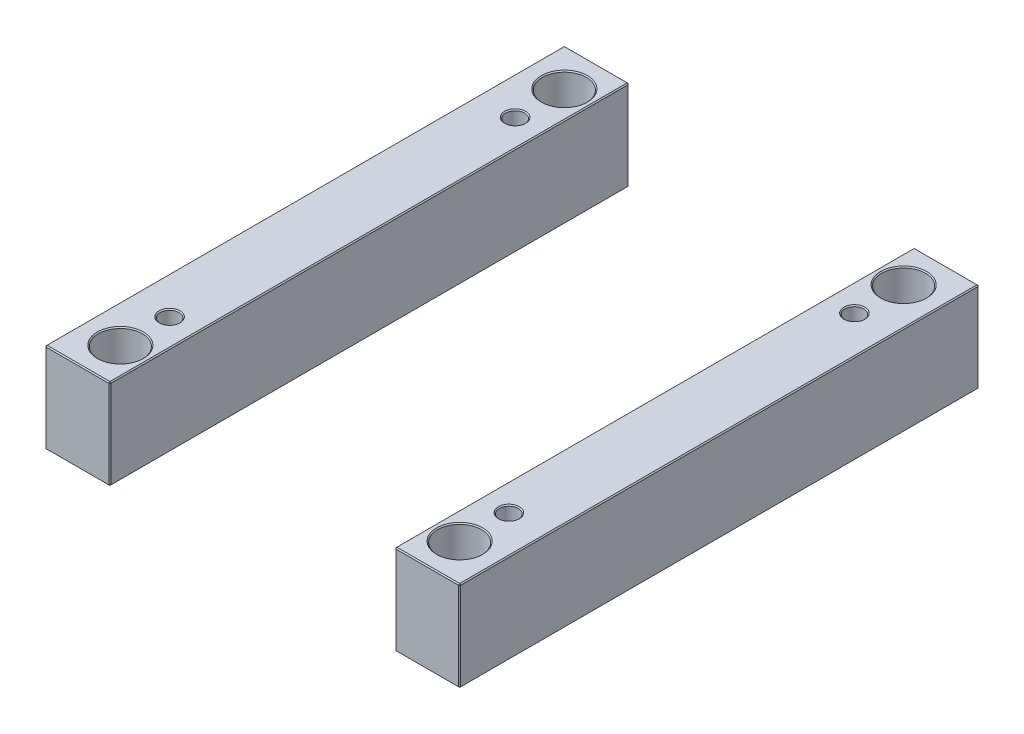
ISO-10303-21;
HEADER;
FILE_DESCRIPTION(('STEP AP214'),'2;1');
FILE_NAME('part.step','',(''),(''),'','','');
FILE_SCHEMA(('AUTOMOTIVE_DESIGN { 1 0 10303 214 1 1 1 1 }'));
ENDSEC;
DATA;
#1=APPLICATION_CONTEXT('core data for automotive mechanical design processes');
#2=APPLICATION_PROTOCOL_DEFINITION('international standard','automotive_design',2000,#1);
#3=PRODUCT_CONTEXT('',#1,'mechanical');
#4=PRODUCT('Part','Part','',(#3));
#5=PRODUCT_RELATED_PRODUCT_CATEGORY('part','',(#4));
#6=PRODUCT_DEFINITION_FORMATION('','',#4);
#7=PRODUCT_DEFINITION_CONTEXT('part definition',#1,'design');
#8=PRODUCT_DEFINITION('design','',#6,#7);
#9=PRODUCT_DEFINITION_SHAPE('','',#8);
#10=(LENGTH_UNIT() NAMED_UNIT(*) SI_UNIT(.MILLI.,.METRE.));
#11=(NAMED_UNIT(*) PLANE_ANGLE_UNIT() SI_UNIT($,.RADIAN.));
#12=(NAMED_UNIT(*) SI_UNIT($,.STERADIAN.) SOLID_ANGLE_UNIT());
#13=UNCERTAINTY_MEASURE_WITH_UNIT(LENGTH_MEASURE(1.E-05),#10,'distance_accuracy_value','');
#14=(GEOMETRIC_REPRESENTATION_CONTEXT(3) GLOBAL_UNCERTAINTY_ASSIGNED_CONTEXT((#13)) GLOBAL_UNIT_ASSIGNED_CONTEXT((#10,
#11,#12)) REPRESENTATION_CONTEXT('',''));
#15=CARTESIAN_POINT('',(0.,0.,0.));
#16=DIRECTION('',(0.,0.,1.));
#17=DIRECTION('',(1.,0.,0.));
#18=AXIS2_PLACEMENT_3D('',#15,#16,#17);
#19=CARTESIAN_POINT('',(-198.,86.,-248.));
#20=DIRECTION('',(0.,0.,1.));
#21=DIRECTION('',(1.,0.,0.));
#22=AXIS2_PLACEMENT_3D('',#19,#20,#21);
#23=PLANE('',#22);
#24=DIRECTION('',(-1.,0.,0.));
#25=VECTOR('',#24,1.);
#26=CARTESIAN_POINT('',(-198.,1.,-248.));
#27=LINE('',#26,#25);
#28=CARTESIAN_POINT('',(-137.,1.,-248.));
#29=VERTEX_POINT('',#28);
#30=CARTESIAN_POINT('',(-197.,1.,-248.));
#31=VERTEX_POINT('',#30);
#32=EDGE_CURVE('P0_E137',#29,#31,#27,.T.);
#33=ORIENTED_EDGE('',*,*,#32,.T.);
#34=DIRECTION('',(0.,1.,0.));
#35=VECTOR('',#34,1.);
#36=CARTESIAN_POINT('',(-197.,86.,-248.));
#37=LINE('',#36,#35);
#38=CARTESIAN_POINT('',(-197.,85.,-248.));
#39=VERTEX_POINT('',#38);
#40=EDGE_CURVE('P0_E265',#31,#39,#37,.T.);
#41=ORIENTED_EDGE('',*,*,#40,.T.);
#42=DIRECTION('',(1.,0.,0.));
#43=VECTOR('',#42,1.);
#44=CARTESIAN_POINT('',(-198.,85.,-248.));
#45=LINE('',#44,#43);
#46=CARTESIAN_POINT('',(-137.,85.,-248.));
#47=VERTEX_POINT('',#46);
#48=EDGE_CURVE('P0_E263',#39,#47,#45,.T.);
#49=ORIENTED_EDGE('',*,*,#48,.T.);
#50=DIRECTION('',(0.,-1.,0.));
#51=VECTOR('',#50,1.);
#52=CARTESIAN_POINT('',(-137.,86.,-248.));
#53=LINE('',#52,#51);
#54=EDGE_CURVE('P0_E260',#47,#29,#53,.T.);
#55=ORIENTED_EDGE('',*,*,#54,.T.);
#56=EDGE_LOOP('',(#33,#41,#49,#55));
#57=FACE_BOUND('',#56,.T.);
#58=ADVANCED_FACE('P0_F16',(#57),#23,.F.);
#59=CARTESIAN_POINT('',(-198.,86.,248.));
#60=DIRECTION('',(1.,0.,0.));
#61=DIRECTION('',(0.,0.,-1.));
#62=AXIS2_PLACEMENT_3D('',#59,#60,#61);
#63=PLANE('',#62);
#64=DIRECTION('',(0.,1.,0.));
#65=VECTOR('',#64,1.);
#66=CARTESIAN_POINT('',(-198.,86.,247.));
#67=LINE('',#66,#65);
#68=CARTESIAN_POINT('',(-198.,1.,247.));
#69=VERTEX_POINT('',#68);
#70=CARTESIAN_POINT('',(-198.,85.,247.));
#71=VERTEX_POINT('',#70);
#72=EDGE_CURVE('P0_E253',#69,#71,#67,.T.);
#73=ORIENTED_EDGE('',*,*,#72,.T.);
#74=DIRECTION('',(0.,0.,-1.));
#75=VECTOR('',#74,1.);
#76=CARTESIAN_POINT('',(-198.,85.,248.));
#77=LINE('',#76,#75);
#78=CARTESIAN_POINT('',(-198.,85.,-247.));
#79=VERTEX_POINT('',#78);
#80=EDGE_CURVE('P0_E258',#71,#79,#77,.T.);
#81=ORIENTED_EDGE('',*,*,#80,.T.);
#82=DIRECTION('',(0.,-1.,0.));
#83=VECTOR('',#82,1.);
#84=CARTESIAN_POINT('',(-198.,86.,-247.));
#85=LINE('',#84,#83);
#86=CARTESIAN_POINT('',(-198.,1.,-247.));
#87=VERTEX_POINT('',#86);
#88=EDGE_CURVE('P0_E255',#79,#87,#85,.T.);
#89=ORIENTED_EDGE('',*,*,#88,.T.);
#90=DIRECTION('',(0.,0.,1.));
#91=VECTOR('',#90,1.);
#92=CARTESIAN_POINT('',(-198.,1.,248.));
#93=LINE('',#92,#91);
#94=EDGE_CURVE('P0_E251',#87,#69,#93,.T.);
#95=ORIENTED_EDGE('',*,*,#94,.T.);
#96=EDGE_LOOP('',(#73,#81,#89,#95));
#97=FACE_BOUND('',#96,.T.);
#98=ADVANCED_FACE('P0_F333',(#97),#63,.F.);
#99=CARTESIAN_POINT('',(-198.,86.,248.));
#100=DIRECTION('',(0.,0.,-1.));
#101=DIRECTION('',(-1.,0.,0.));
#102=AXIS2_PLACEMENT_3D('',#99,#100,#101);
#103=PLANE('',#102);
#104=DIRECTION('',(-1.,0.,0.));
#105=VECTOR('',#104,1.);
#106=CARTESIAN_POINT('',(-198.,85.,248.));
#107=LINE('',#106,#105);
#108=CARTESIAN_POINT('',(-137.,85.,248.));
#109=VERTEX_POINT('',#108);
#110=CARTESIAN_POINT('',(-197.,85.,248.));
#111=VERTEX_POINT('',#110);
#112=EDGE_CURVE('P0_E272',#109,#111,#107,.T.);
#113=ORIENTED_EDGE('',*,*,#112,.T.);
#114=DIRECTION('',(0.,-1.,0.));
#115=VECTOR('',#114,1.);
#116=CARTESIAN_POINT('',(-197.,86.,248.));
#117=LINE('',#116,#115);
#118=CARTESIAN_POINT('',(-197.,1.,248.));
#119=VERTEX_POINT('',#118);
#120=EDGE_CURVE('P0_E274',#111,#119,#117,.T.);
#121=ORIENTED_EDGE('',*,*,#120,.T.);
#122=DIRECTION('',(1.,0.,0.));
#123=VECTOR('',#122,1.);
#124=CARTESIAN_POINT('',(-136.,1.,248.));
#125=LINE('',#124,#123);
#126=CARTESIAN_POINT('',(-137.,1.,248.));
#127=VERTEX_POINT('',#126);
#128=EDGE_CURVE('P0_E270',#119,#127,#125,.T.);
#129=ORIENTED_EDGE('',*,*,#128,.T.);
#130=DIRECTION('',(0.,1.,0.));
#131=VECTOR('',#130,1.);
#132=CARTESIAN_POINT('',(-137.,86.,248.));
#133=LINE('',#132,#131);
#134=EDGE_CURVE('P0_E268',#127,#109,#133,.T.);
#135=ORIENTED_EDGE('',*,*,#134,.T.);
#136=EDGE_LOOP('',(#113,#121,#129,#135));
#137=FACE_BOUND('',#136,.T.);
#138=ADVANCED_FACE('P0_F372',(#137),#103,.F.);
#139=CARTESIAN_POINT('',(-136.,86.,-248.));
#140=DIRECTION('',(-1.,0.,0.));
#141=DIRECTION('',(0.,0.,1.));
#142=AXIS2_PLACEMENT_3D('',#139,#140,#141);
#143=PLANE('',#142);
#144=DIRECTION('',(0.,0.,1.));
#145=VECTOR('',#144,1.);
#146=CARTESIAN_POINT('',(-136.,85.,-248.));
#147=LINE('',#146,#145);
#148=CARTESIAN_POINT('',(-136.,85.,-247.));
#149=VERTEX_POINT('',#148);
#150=CARTESIAN_POINT('',(-136.,85.,247.));
#151=VERTEX_POINT('',#150);
#152=EDGE_CURVE('P0_E31',#149,#151,#147,.T.);
#153=ORIENTED_EDGE('',*,*,#152,.T.);
#154=DIRECTION('',(0.,-1.,0.));
#155=VECTOR('',#154,1.);
#156=CARTESIAN_POINT('',(-136.,86.,247.));
#157=LINE('',#156,#155);
#158=CARTESIAN_POINT('',(-136.,1.,247.));
#159=VERTEX_POINT('',#158);
#160=EDGE_CURVE('P0_E190',#151,#159,#157,.T.);
#161=ORIENTED_EDGE('',*,*,#160,.T.);
#162=DIRECTION('',(0.,0.,-1.));
#163=VECTOR('',#162,1.);
#164=CARTESIAN_POINT('',(-136.,1.,-248.));
#165=LINE('',#164,#163);
#166=CARTESIAN_POINT('',(-136.,1.,-247.));
#167=VERTEX_POINT('',#166);
#168=EDGE_CURVE('P0_E286',#159,#167,#165,.T.);
#169=ORIENTED_EDGE('',*,*,#168,.T.);
#170=DIRECTION('',(0.,1.,0.));
#171=VECTOR('',#170,1.);
#172=CARTESIAN_POINT('',(-136.,86.,-247.));
#173=LINE('',#172,#171);
#174=EDGE_CURVE('P0_E36',#167,#149,#173,.T.);
#175=ORIENTED_EDGE('',*,*,#174,.T.);
#176=EDGE_LOOP('',(#153,#161,#169,#175));
#177=FACE_BOUND('',#176,.T.);
#178=ADVANCED_FACE('P0_F649',(#177),#143,.F.);
#179=CARTESIAN_POINT('',(0.,86.,0.));
#180=DIRECTION('',(0.,-1.,0.));
#181=DIRECTION('',(0.,0.,-1.));
#182=AXIS2_PLACEMENT_3D('',#179,#180,#181);
#183=PLANE('',#182);
#184=CARTESIAN_POINT('',(-162.,86.,-212.));
#185=DIRECTION('',(0.,-1.,0.));
#186=DIRECTION('',(0.,0.,-1.));
#187=AXIS2_PLACEMENT_3D('',#184,#185,#186);
#188=CIRCLE('',#187,22.);
#189=CARTESIAN_POINT('',(-162.,86.,-234.));
#190=VERTEX_POINT('',#189);
#191=EDGE_CURVE('P0_E214',#190,#190,#188,.T.);
#192=ORIENTED_EDGE('',*,*,#191,.T.);
#193=EDGE_LOOP('',(#192));
#194=FACE_BOUND('',#193,.T.);
#195=CARTESIAN_POINT('',(-162.,86.,212.));
#196=DIRECTION('',(0.,-1.,0.));
#197=DIRECTION('',(0.,0.,-1.));
#198=AXIS2_PLACEMENT_3D('',#195,#196,#197);
#199=CIRCLE('',#198,22.);
#200=CARTESIAN_POINT('',(-162.,86.,190.));
#201=VERTEX_POINT('',#200);
#202=EDGE_CURVE('P0_E211',#201,#201,#199,.T.);
#203=ORIENTED_EDGE('',*,*,#202,.T.);
#204=EDGE_LOOP('',(#203));
#205=FACE_BOUND('',#204,.T.);
#206=CARTESIAN_POINT('',(-162.,86.,165.));
#207=DIRECTION('',(0.,-1.,0.));
#208=DIRECTION('',(0.,0.,-1.));
#209=AXIS2_PLACEMENT_3D('',#206,#207,#208);
#210=CIRCLE('',#209,10.);
#211=CARTESIAN_POINT('',(-162.,86.,155.));
#212=VERTEX_POINT('',#211);
#213=EDGE_CURVE('P0_E193',#212,#212,#210,.T.);
#214=ORIENTED_EDGE('',*,*,#213,.T.);
#215=EDGE_LOOP('',(#214));
#216=FACE_BOUND('',#215,.T.);
#217=CARTESIAN_POINT('',(-162.,86.,-165.));
#218=DIRECTION('',(0.,-1.,0.));
#219=DIRECTION('',(0.,0.,-1.));
#220=AXIS2_PLACEMENT_3D('',#217,#218,#219);
#221=CIRCLE('',#220,10.);
#222=CARTESIAN_POINT('',(-162.,86.,-175.));
#223=VERTEX_POINT('',#222);
#224=EDGE_CURVE('P0_E189',#223,#223,#221,.T.);
#225=ORIENTED_EDGE('',*,*,#224,.T.);
#226=EDGE_LOOP('',(#225));
#227=FACE_BOUND('',#226,.T.);
#228=DIRECTION('',(0.,0.,1.));
#229=VECTOR('',#228,1.);
#230=CARTESIAN_POINT('',(-197.,86.,0.));
#231=LINE('',#230,#229);
#232=CARTESIAN_POINT('',(-197.,86.,-247.));
#233=VERTEX_POINT('',#232);
#234=CARTESIAN_POINT('',(-197.,86.,247.));
#235=VERTEX_POINT('',#234);
#236=EDGE_CURVE('P0_E281',#233,#235,#231,.T.);
#237=ORIENTED_EDGE('',*,*,#236,.T.);
#238=DIRECTION('',(1.,0.,0.));
#239=VECTOR('',#238,1.);
#240=CARTESIAN_POINT('',(0.,86.,247.));
#241=LINE('',#240,#239);
#242=CARTESIAN_POINT('',(-137.,86.,247.));
#243=VERTEX_POINT('',#242);
#244=EDGE_CURVE('P0_E283',#235,#243,#241,.T.);
#245=ORIENTED_EDGE('',*,*,#244,.T.);
#246=DIRECTION('',(0.,0.,-1.));
#247=VECTOR('',#246,1.);
#248=CARTESIAN_POINT('',(-137.,86.,0.));
#249=LINE('',#248,#247);
#250=CARTESIAN_POINT('',(-137.,86.,-247.));
#251=VERTEX_POINT('',#250);
#252=EDGE_CURVE('P0_E277',#243,#251,#249,.T.);
#253=ORIENTED_EDGE('',*,*,#252,.T.);
#254=DIRECTION('',(-1.,0.,0.));
#255=VECTOR('',#254,1.);
#256=CARTESIAN_POINT('',(0.,86.,-247.));
#257=LINE('',#256,#255);
#258=EDGE_CURVE('P0_E279',#251,#233,#257,.T.);
#259=ORIENTED_EDGE('',*,*,#258,.T.);
#260=EDGE_LOOP('',(#237,#245,#253,#259));
#261=FACE_BOUND('',#260,.T.);
#262=ADVANCED_FACE('P0_F229',(#194,#205,#216,#227,#261),#183,.F.);
#263=CARTESIAN_POINT('',(0.,0.,0.));
#264=DIRECTION('',(0.,-1.,0.));
#265=DIRECTION('',(0.,0.,-1.));
#266=AXIS2_PLACEMENT_3D('',#263,#264,#265);
#267=PLANE('',#266);
#268=CARTESIAN_POINT('',(-162.,0.,-212.));
#269=DIRECTION('',(0.,-1.,0.));
#270=DIRECTION('',(0.,0.,-1.));
#271=AXIS2_PLACEMENT_3D('',#268,#269,#270);
#272=CIRCLE('',#271,22.);
#273=CARTESIAN_POINT('',(-162.,0.,-234.));
#274=VERTEX_POINT('',#273);
#275=EDGE_CURVE('P0_E202',#274,#274,#272,.F.);
#276=ORIENTED_EDGE('',*,*,#275,.T.);
#277=EDGE_LOOP('',(#276));
#278=FACE_BOUND('',#277,.T.);
#279=CARTESIAN_POINT('',(-162.,0.,212.));
#280=DIRECTION('',(0.,-1.,0.));
#281=DIRECTION('',(0.,0.,-1.));
#282=AXIS2_PLACEMENT_3D('',#279,#280,#281);
#283=CIRCLE('',#282,22.);
#284=CARTESIAN_POINT('',(-162.,0.,190.));
#285=VERTEX_POINT('',#284);
#286=EDGE_CURVE('P0_E199',#285,#285,#283,.F.);
#287=ORIENTED_EDGE('',*,*,#286,.T.);
#288=EDGE_LOOP('',(#287));
#289=FACE_BOUND('',#288,.T.);
#290=CARTESIAN_POINT('',(-162.,0.,-165.));
#291=DIRECTION('',(0.,-1.,0.));
#292=DIRECTION('',(0.,0.,-1.));
#293=AXIS2_PLACEMENT_3D('',#290,#291,#292);
#294=CIRCLE('',#293,10.);
#295=CARTESIAN_POINT('',(-162.,0.,-175.));
#296=VERTEX_POINT('',#295);
#297=EDGE_CURVE('P0_E235',#296,#296,#294,.F.);
#298=ORIENTED_EDGE('',*,*,#297,.T.);
#299=EDGE_LOOP('',(#298));
#300=FACE_BOUND('',#299,.T.);
#301=CARTESIAN_POINT('',(-162.,0.,165.));
#302=DIRECTION('',(0.,-1.,0.));
#303=DIRECTION('',(0.,0.,-1.));
#304=AXIS2_PLACEMENT_3D('',#301,#302,#303);
#305=CIRCLE('',#304,10.);
#306=CARTESIAN_POINT('',(-162.,0.,155.));
#307=VERTEX_POINT('',#306);
#308=EDGE_CURVE('P0_E238',#307,#307,#305,.F.);
#309=ORIENTED_EDGE('',*,*,#308,.T.);
#310=EDGE_LOOP('',(#309));
#311=FACE_BOUND('',#310,.T.);
#312=DIRECTION('',(-1.,0.,0.));
#313=VECTOR('',#312,1.);
#314=CARTESIAN_POINT('',(-198.,0.,247.));
#315=LINE('',#314,#313);
#316=CARTESIAN_POINT('',(-137.,0.,247.));
#317=VERTEX_POINT('',#316);
#318=CARTESIAN_POINT('',(-197.,0.,247.));
#319=VERTEX_POINT('',#318);
#320=EDGE_CURVE('P0_E114',#317,#319,#315,.T.);
#321=ORIENTED_EDGE('',*,*,#320,.T.);
#322=DIRECTION('',(0.,0.,-1.));
#323=VECTOR('',#322,1.);
#324=CARTESIAN_POINT('',(-197.,0.,-248.));
#325=LINE('',#324,#323);
#326=CARTESIAN_POINT('',(-197.,0.,-247.));
#327=VERTEX_POINT('',#326);
#328=EDGE_CURVE('P0_E110',#319,#327,#325,.T.);
#329=ORIENTED_EDGE('',*,*,#328,.T.);
#330=DIRECTION('',(1.,0.,0.));
#331=VECTOR('',#330,1.);
#332=CARTESIAN_POINT('',(-136.,0.,-247.));
#333=LINE('',#332,#331);
#334=CARTESIAN_POINT('',(-137.,0.,-247.));
#335=VERTEX_POINT('',#334);
#336=EDGE_CURVE('P0_E104',#327,#335,#333,.T.);
#337=ORIENTED_EDGE('',*,*,#336,.T.);
#338=DIRECTION('',(0.,0.,1.));
#339=VECTOR('',#338,1.);
#340=CARTESIAN_POINT('',(-137.,0.,248.));
#341=LINE('',#340,#339);
#342=EDGE_CURVE('P0_E107',#335,#317,#341,.T.);
#343=ORIENTED_EDGE('',*,*,#342,.T.);
#344=EDGE_LOOP('',(#321,#329,#337,#343));
#345=FACE_BOUND('',#344,.T.);
#346=ADVANCED_FACE('P0_F106',(#278,#289,#300,#311,#345),#267,.T.);
#347=CARTESIAN_POINT('',(-162.,0.,-165.));
#348=DIRECTION('',(0.,1.,0.));
#349=DIRECTION('',(0.,0.,1.));
#350=AXIS2_PLACEMENT_3D('',#347,#348,#349);
#351=CYLINDRICAL_SURFACE('',#350,9.);
#352=CARTESIAN_POINT('',(-162.,85.,-165.));
#353=DIRECTION('',(0.,-1.,0.));
#354=DIRECTION('',(0.,0.,-1.));
#355=AXIS2_PLACEMENT_3D('',#352,#353,#354);
#356=CIRCLE('',#355,9.);
#357=CARTESIAN_POINT('',(-162.,85.,-174.));
#358=VERTEX_POINT('',#357);
#359=EDGE_CURVE('P0_E196',#358,#358,#356,.F.);
#360=ORIENTED_EDGE('',*,*,#359,.T.);
#361=EDGE_LOOP('',(#360));
#362=FACE_BOUND('',#361,.T.);
#363=CARTESIAN_POINT('',(-162.,0.999999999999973,-165.));
#364=DIRECTION('',(0.,-1.,0.));
#365=DIRECTION('',(0.,0.,-1.));
#366=AXIS2_PLACEMENT_3D('',#363,#364,#365);
#367=CIRCLE('',#366,9.);
#368=CARTESIAN_POINT('',(-162.,0.999999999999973,-174.));
#369=VERTEX_POINT('',#368);
#370=EDGE_CURVE('P0_E241',#369,#369,#367,.T.);
#371=ORIENTED_EDGE('',*,*,#370,.T.);
#372=EDGE_LOOP('',(#371));
#373=FACE_BOUND('',#372,.T.);
#374=ADVANCED_FACE('P0_F228',(#362,#373),#351,.F.);
#375=CARTESIAN_POINT('',(-162.,0.,165.));
#376=DIRECTION('',(0.,1.,0.));
#377=DIRECTION('',(0.,0.,1.));
#378=AXIS2_PLACEMENT_3D('',#375,#376,#377);
#379=CYLINDRICAL_SURFACE('',#378,9.);
#380=CARTESIAN_POINT('',(-162.,85.,165.));
#381=DIRECTION('',(0.,-1.,0.));
#382=DIRECTION('',(0.,0.,-1.));
#383=AXIS2_PLACEMENT_3D('',#380,#381,#382);
#384=CIRCLE('',#383,9.);
#385=CARTESIAN_POINT('',(-162.,85.,156.));
#386=VERTEX_POINT('',#385);
#387=EDGE_CURVE('P0_E186',#386,#386,#384,.F.);
#388=ORIENTED_EDGE('',*,*,#387,.T.);
#389=EDGE_LOOP('',(#388));
#390=FACE_BOUND('',#389,.T.);
#391=CARTESIAN_POINT('',(-162.,0.999999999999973,165.));
#392=DIRECTION('',(0.,-1.,0.));
#393=DIRECTION('',(0.,0.,-1.));
#394=AXIS2_PLACEMENT_3D('',#391,#392,#393);
#395=CIRCLE('',#394,9.);
#396=CARTESIAN_POINT('',(-162.,0.999999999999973,156.));
#397=VERTEX_POINT('',#396);
#398=EDGE_CURVE('P0_E248',#397,#397,#395,.T.);
#399=ORIENTED_EDGE('',*,*,#398,.T.);
#400=EDGE_LOOP('',(#399));
#401=FACE_BOUND('',#400,.T.);
#402=ADVANCED_FACE('P0_F380',(#390,#401),#379,.F.);
#403=CARTESIAN_POINT('',(-162.,0.,-165.));
#404=DIRECTION('',(0.,-1.,0.));
#405=DIRECTION('',(0.,0.,-1.));
#406=AXIS2_PLACEMENT_3D('',#403,#404,#405);
#407=CONICAL_SURFACE('',#406,10.,0.78539816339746);
#408=ORIENTED_EDGE('',*,*,#370,.F.);
#409=EDGE_LOOP('',(#408));
#410=FACE_BOUND('',#409,.T.);
#411=ORIENTED_EDGE('',*,*,#297,.F.);
#412=EDGE_LOOP('',(#411));
#413=FACE_BOUND('',#412,.T.);
#414=ADVANCED_FACE('P0_F376',(#410,#413),#407,.F.);
#415=CARTESIAN_POINT('',(-162.,0.,165.));
#416=DIRECTION('',(0.,-1.,0.));
#417=DIRECTION('',(0.,0.,-1.));
#418=AXIS2_PLACEMENT_3D('',#415,#416,#417);
#419=CONICAL_SURFACE('',#418,10.,0.78539816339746);
#420=ORIENTED_EDGE('',*,*,#398,.F.);
#421=EDGE_LOOP('',(#420));
#422=FACE_BOUND('',#421,.T.);
#423=ORIENTED_EDGE('',*,*,#308,.F.);
#424=EDGE_LOOP('',(#423));
#425=FACE_BOUND('',#424,.T.);
#426=ADVANCED_FACE('P0_F379',(#422,#425),#419,.F.);
#427=CARTESIAN_POINT('',(-136.,86.,247.));
#428=DIRECTION('',(-0.707106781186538,0.,-0.707106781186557));
#429=DIRECTION('',(0.,-1.,0.));
#430=AXIS2_PLACEMENT_3D('',#427,#428,#429);
#431=PLANE('',#430);
#432=DIRECTION('',(-0.707106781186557,0.,0.707106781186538));
#433=VECTOR('',#432,1.);
#434=CARTESIAN_POINT('',(-136.5,85.,247.5));
#435=LINE('',#434,#433);
#436=EDGE_CURVE('P0_E125',#109,#151,#435,.F.);
#437=ORIENTED_EDGE('',*,*,#436,.F.);
#438=ORIENTED_EDGE('',*,*,#134,.F.);
#439=DIRECTION('',(0.707106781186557,0.,-0.707106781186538));
#440=VECTOR('',#439,1.);
#441=CARTESIAN_POINT('',(-137.,1.,248.));
#442=LINE('',#441,#440);
#443=EDGE_CURVE('P0_E181',#159,#127,#442,.F.);
#444=ORIENTED_EDGE('',*,*,#443,.F.);
#445=ORIENTED_EDGE('',*,*,#160,.F.);
#446=EDGE_LOOP('',(#437,#438,#444,#445));
#447=FACE_BOUND('',#446,.T.);
#448=ADVANCED_FACE('P0_F384',(#447),#431,.F.);
#449=CARTESIAN_POINT('',(-137.,86.,247.));
#450=DIRECTION('',(0.577350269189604,0.57735026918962,0.577350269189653));
#451=DIRECTION('',(0.,-0.707106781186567,0.707106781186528));
#452=AXIS2_PLACEMENT_3D('',#449,#450,#451);
#453=PLANE('',#452);
#454=DIRECTION('',(0.,0.707106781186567,-0.707106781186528));
#455=VECTOR('',#454,1.);
#456=CARTESIAN_POINT('',(-137.,86.,247.));
#457=LINE('',#456,#455);
#458=EDGE_CURVE('P0_E175',#109,#243,#457,.T.);
#459=ORIENTED_EDGE('',*,*,#458,.F.);
#460=ORIENTED_EDGE('',*,*,#436,.T.);
#461=DIRECTION('',(0.707106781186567,-0.707106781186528,0.));
#462=VECTOR('',#461,1.);
#463=CARTESIAN_POINT('',(-137.,86.,247.));
#464=LINE('',#463,#462);
#465=EDGE_CURVE('P0_E178',#243,#151,#464,.T.);
#466=ORIENTED_EDGE('',*,*,#465,.F.);
#467=EDGE_LOOP('',(#459,#460,#466));
#468=FACE_BOUND('',#467,.T.);
#469=ADVANCED_FACE('P0_F588',(#468),#453,.T.);
#470=CARTESIAN_POINT('',(-137.,1.,248.));
#471=DIRECTION('',(0.577350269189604,-0.577350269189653,0.57735026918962));
#472=DIRECTION('',(0.,-0.707106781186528,-0.707106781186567));
#473=AXIS2_PLACEMENT_3D('',#470,#471,#472);
#474=PLANE('',#473);
#475=DIRECTION('',(0.707106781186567,0.707106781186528,0.));
#476=VECTOR('',#475,1.);
#477=CARTESIAN_POINT('',(-136.5,0.499999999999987,247.));
#478=LINE('',#477,#476);
#479=EDGE_CURVE('P0_E123',#159,#317,#478,.F.);
#480=ORIENTED_EDGE('',*,*,#479,.F.);
#481=ORIENTED_EDGE('',*,*,#443,.T.);
#482=DIRECTION('',(0.,-0.707106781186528,-0.707106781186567));
#483=VECTOR('',#482,1.);
#484=CARTESIAN_POINT('',(-137.,1.,248.));
#485=LINE('',#484,#483);
#486=EDGE_CURVE('P0_E172',#317,#127,#485,.F.);
#487=ORIENTED_EDGE('',*,*,#486,.F.);
#488=EDGE_LOOP('',(#480,#481,#487));
#489=FACE_BOUND('',#488,.T.);
#490=ADVANCED_FACE('P0_F597',(#489),#474,.T.);
#491=CARTESIAN_POINT('',(-137.,86.,0.));
#492=DIRECTION('',(-0.707106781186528,-0.707106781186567,0.));
#493=DIRECTION('',(0.,0.,-1.));
#494=AXIS2_PLACEMENT_3D('',#491,#492,#493);
#495=PLANE('',#494);
#496=ORIENTED_EDGE('',*,*,#465,.T.);
#497=ORIENTED_EDGE('',*,*,#152,.F.);
#498=DIRECTION('',(-0.707106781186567,0.707106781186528,0.));
#499=VECTOR('',#498,1.);
#500=CARTESIAN_POINT('',(-136.5,85.5,-247.));
#501=LINE('',#500,#499);
#502=EDGE_CURVE('P0_E165',#251,#149,#501,.F.);
#503=ORIENTED_EDGE('',*,*,#502,.F.);
#504=ORIENTED_EDGE('',*,*,#252,.F.);
#505=EDGE_LOOP('',(#496,#497,#503,#504));
#506=FACE_BOUND('',#505,.T.);
#507=ADVANCED_FACE('P0_F349',(#506),#495,.F.);
#508=CARTESIAN_POINT('',(0.,86.,247.));
#509=DIRECTION('',(0.,-0.707106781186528,-0.707106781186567));
#510=DIRECTION('',(1.,0.,0.));
#511=AXIS2_PLACEMENT_3D('',#508,#509,#510);
#512=PLANE('',#511);
#513=ORIENTED_EDGE('',*,*,#458,.T.);
#514=ORIENTED_EDGE('',*,*,#244,.F.);
#515=DIRECTION('',(0.,-0.707106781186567,0.707106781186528));
#516=VECTOR('',#515,1.);
#517=CARTESIAN_POINT('',(-197.,85.5,247.5));
#518=LINE('',#517,#516);
#519=EDGE_CURVE('P0_E162',#111,#235,#518,.F.);
#520=ORIENTED_EDGE('',*,*,#519,.F.);
#521=ORIENTED_EDGE('',*,*,#112,.F.);
#522=EDGE_LOOP('',(#513,#514,#520,#521));
#523=FACE_BOUND('',#522,.T.);
#524=ADVANCED_FACE('P0_F344',(#523),#512,.F.);
#525=CARTESIAN_POINT('',(-197.,86.,248.));
#526=DIRECTION('',(0.707106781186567,0.,-0.707106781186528));
#527=DIRECTION('',(0.,-1.,0.));
#528=AXIS2_PLACEMENT_3D('',#525,#526,#527);
#529=PLANE('',#528);
#530=DIRECTION('',(0.707106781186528,0.,0.707106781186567));
#531=VECTOR('',#530,1.);
#532=CARTESIAN_POINT('',(-197.,1.,248.));
#533=LINE('',#532,#531);
#534=EDGE_CURVE('P0_E156',#119,#69,#533,.F.);
#535=ORIENTED_EDGE('',*,*,#534,.F.);
#536=ORIENTED_EDGE('',*,*,#120,.F.);
#537=DIRECTION('',(-0.707106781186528,0.,-0.707106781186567));
#538=VECTOR('',#537,1.);
#539=CARTESIAN_POINT('',(-198.,85.,247.));
#540=LINE('',#539,#538);
#541=EDGE_CURVE('P0_E159',#71,#111,#540,.F.);
#542=ORIENTED_EDGE('',*,*,#541,.F.);
#543=ORIENTED_EDGE('',*,*,#72,.F.);
#544=EDGE_LOOP('',(#535,#536,#542,#543));
#545=FACE_BOUND('',#544,.T.);
#546=ADVANCED_FACE('P0_F338',(#545),#529,.F.);
#547=CARTESIAN_POINT('',(-198.,1.,248.));
#548=DIRECTION('',(0.,-0.707106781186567,0.707106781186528));
#549=DIRECTION('',(-1.,0.,0.));
#550=AXIS2_PLACEMENT_3D('',#547,#548,#549);
#551=PLANE('',#550);
#552=ORIENTED_EDGE('',*,*,#486,.T.);
#553=ORIENTED_EDGE('',*,*,#128,.F.);
#554=DIRECTION('',(0.,0.707106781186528,0.707106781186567));
#555=VECTOR('',#554,1.);
#556=CARTESIAN_POINT('',(-197.,1.,248.));
#557=LINE('',#556,#555);
#558=EDGE_CURVE('P0_E134',#319,#119,#557,.T.);
#559=ORIENTED_EDGE('',*,*,#558,.F.);
#560=ORIENTED_EDGE('',*,*,#320,.F.);
#561=EDGE_LOOP('',(#552,#553,#559,#560));
#562=FACE_BOUND('',#561,.T.);
#563=ADVANCED_FACE('P0_F364',(#562),#551,.T.);
#564=CARTESIAN_POINT('',(-136.,1.,-248.));
#565=DIRECTION('',(0.707106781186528,-0.707106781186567,0.));
#566=DIRECTION('',(0.,0.,1.));
#567=AXIS2_PLACEMENT_3D('',#564,#565,#566);
#568=PLANE('',#567);
#569=ORIENTED_EDGE('',*,*,#479,.T.);
#570=ORIENTED_EDGE('',*,*,#342,.F.);
#571=DIRECTION('',(-0.707106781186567,-0.707106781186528,0.));
#572=VECTOR('',#571,1.);
#573=CARTESIAN_POINT('',(-137.,0.,-247.));
#574=LINE('',#573,#572);
#575=EDGE_CURVE('P0_E120',#167,#335,#574,.T.);
#576=ORIENTED_EDGE('',*,*,#575,.F.);
#577=ORIENTED_EDGE('',*,*,#168,.F.);
#578=EDGE_LOOP('',(#569,#570,#576,#577));
#579=FACE_BOUND('',#578,.T.);
#580=ADVANCED_FACE('P0_F119',(#579),#568,.T.);
#581=CARTESIAN_POINT('',(-137.,86.,-248.));
#582=DIRECTION('',(-0.707106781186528,0.,0.707106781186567));
#583=DIRECTION('',(0.,-1.,0.));
#584=AXIS2_PLACEMENT_3D('',#581,#582,#583);
#585=PLANE('',#584);
#586=DIRECTION('',(0.707106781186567,0.,0.707106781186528));
#587=VECTOR('',#586,1.);
#588=CARTESIAN_POINT('',(-137.,85.,-248.));
#589=LINE('',#588,#587);
#590=EDGE_CURVE('P0_E168',#149,#47,#589,.F.);
#591=ORIENTED_EDGE('',*,*,#590,.F.);
#592=ORIENTED_EDGE('',*,*,#174,.F.);
#593=DIRECTION('',(-0.707106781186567,0.,-0.707106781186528));
#594=VECTOR('',#593,1.);
#595=CARTESIAN_POINT('',(-136.5,1.,-247.5));
#596=LINE('',#595,#594);
#597=EDGE_CURVE('P0_E133',#29,#167,#596,.F.);
#598=ORIENTED_EDGE('',*,*,#597,.F.);
#599=ORIENTED_EDGE('',*,*,#54,.F.);
#600=EDGE_LOOP('',(#591,#592,#598,#599));
#601=FACE_BOUND('',#600,.T.);
#602=ADVANCED_FACE('P0_F354',(#601),#585,.F.);
#603=CARTESIAN_POINT('',(-137.,85.,-248.));
#604=DIRECTION('',(0.577350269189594,0.577350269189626,-0.577350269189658));
#605=DIRECTION('',(0.,0.707106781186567,0.707106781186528));
#606=AXIS2_PLACEMENT_3D('',#603,#604,#605);
#607=PLANE('',#606);
#608=ORIENTED_EDGE('',*,*,#502,.T.);
#609=ORIENTED_EDGE('',*,*,#590,.T.);
#610=DIRECTION('',(0.,-0.707106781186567,-0.707106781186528));
#611=VECTOR('',#610,1.);
#612=CARTESIAN_POINT('',(-137.,85.,-248.));
#613=LINE('',#612,#611);
#614=EDGE_CURVE('P0_E151',#251,#47,#613,.T.);
#615=ORIENTED_EDGE('',*,*,#614,.F.);
#616=EDGE_LOOP('',(#608,#609,#615));
#617=FACE_BOUND('',#616,.T.);
#618=ADVANCED_FACE('P0_F352',(#617),#607,.T.);
#619=CARTESIAN_POINT('',(-198.,85.,247.));
#620=DIRECTION('',(-0.577350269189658,0.577350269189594,0.577350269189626));
#621=DIRECTION('',(0.707106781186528,0.,0.707106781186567));
#622=AXIS2_PLACEMENT_3D('',#619,#620,#621);
#623=PLANE('',#622);
#624=ORIENTED_EDGE('',*,*,#541,.T.);
#625=ORIENTED_EDGE('',*,*,#519,.T.);
#626=DIRECTION('',(0.707106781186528,0.707106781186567,0.));
#627=VECTOR('',#626,1.);
#628=CARTESIAN_POINT('',(-198.,85.,247.));
#629=LINE('',#628,#627);
#630=EDGE_CURVE('P0_E142',#71,#235,#629,.T.);
#631=ORIENTED_EDGE('',*,*,#630,.F.);
#632=EDGE_LOOP('',(#624,#625,#631));
#633=FACE_BOUND('',#632,.T.);
#634=ADVANCED_FACE('P0_F341',(#633),#623,.T.);
#635=CARTESIAN_POINT('',(-197.,1.,248.));
#636=DIRECTION('',(-0.577350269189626,-0.577350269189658,0.577350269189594));
#637=DIRECTION('',(0.707106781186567,-0.707106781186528,0.));
#638=AXIS2_PLACEMENT_3D('',#635,#636,#637);
#639=PLANE('',#638);
#640=ORIENTED_EDGE('',*,*,#558,.T.);
#641=ORIENTED_EDGE('',*,*,#534,.T.);
#642=DIRECTION('',(0.707106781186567,-0.707106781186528,0.));
#643=VECTOR('',#642,1.);
#644=CARTESIAN_POINT('',(-197.5,0.5,247.));
#645=LINE('',#644,#643);
#646=EDGE_CURVE('P0_E138',#319,#69,#645,.F.);
#647=ORIENTED_EDGE('',*,*,#646,.F.);
#648=EDGE_LOOP('',(#640,#641,#647));
#649=FACE_BOUND('',#648,.T.);
#650=ADVANCED_FACE('P0_F403',(#649),#639,.T.);
#651=CARTESIAN_POINT('',(-137.,0.,-247.));
#652=DIRECTION('',(0.577350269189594,-0.577350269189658,-0.577350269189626));
#653=DIRECTION('',(0.,0.707106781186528,-0.707106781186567));
#654=AXIS2_PLACEMENT_3D('',#651,#652,#653);
#655=PLANE('',#654);
#656=ORIENTED_EDGE('',*,*,#597,.T.);
#657=ORIENTED_EDGE('',*,*,#575,.T.);
#658=DIRECTION('',(0.,0.707106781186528,-0.707106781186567));
#659=VECTOR('',#658,1.);
#660=CARTESIAN_POINT('',(-137.,0.,-247.));
#661=LINE('',#660,#659);
#662=EDGE_CURVE('P0_E130',#29,#335,#661,.F.);
#663=ORIENTED_EDGE('',*,*,#662,.F.);
#664=EDGE_LOOP('',(#656,#657,#663));
#665=FACE_BOUND('',#664,.T.);
#666=ADVANCED_FACE('P0_F129',(#665),#655,.T.);
#667=CARTESIAN_POINT('',(0.,86.,-247.));
#668=DIRECTION('',(0.,-0.707106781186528,0.707106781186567));
#669=DIRECTION('',(-1.,0.,0.));
#670=AXIS2_PLACEMENT_3D('',#667,#668,#669);
#671=PLANE('',#670);
#672=ORIENTED_EDGE('',*,*,#614,.T.);
#673=ORIENTED_EDGE('',*,*,#48,.F.);
#674=DIRECTION('',(0.,0.707106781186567,0.707106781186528));
#675=VECTOR('',#674,1.);
#676=CARTESIAN_POINT('',(-197.,85.,-248.));
#677=LINE('',#676,#675);
#678=EDGE_CURVE('P0_E139',#233,#39,#677,.F.);
#679=ORIENTED_EDGE('',*,*,#678,.F.);
#680=ORIENTED_EDGE('',*,*,#258,.F.);
#681=EDGE_LOOP('',(#672,#673,#679,#680));
#682=FACE_BOUND('',#681,.T.);
#683=ADVANCED_FACE('P0_F316',(#682),#671,.F.);
#684=CARTESIAN_POINT('',(-197.,86.,0.));
#685=DIRECTION('',(0.707106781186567,-0.707106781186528,0.));
#686=DIRECTION('',(0.,0.,1.));
#687=AXIS2_PLACEMENT_3D('',#684,#685,#686);
#688=PLANE('',#687);
#689=ORIENTED_EDGE('',*,*,#630,.T.);
#690=ORIENTED_EDGE('',*,*,#236,.F.);
#691=DIRECTION('',(-0.707106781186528,-0.707106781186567,0.));
#692=VECTOR('',#691,1.);
#693=CARTESIAN_POINT('',(-197.5,85.5,-247.));
#694=LINE('',#693,#692);
#695=EDGE_CURVE('P0_E145',#79,#233,#694,.F.);
#696=ORIENTED_EDGE('',*,*,#695,.F.);
#697=ORIENTED_EDGE('',*,*,#80,.F.);
#698=EDGE_LOOP('',(#689,#690,#696,#697));
#699=FACE_BOUND('',#698,.T.);
#700=ADVANCED_FACE('P0_F310',(#699),#688,.F.);
#701=CARTESIAN_POINT('',(-198.,1.,248.));
#702=DIRECTION('',(-0.707106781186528,-0.707106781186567,0.));
#703=DIRECTION('',(0.,0.,-1.));
#704=AXIS2_PLACEMENT_3D('',#701,#702,#703);
#705=PLANE('',#704);
#706=ORIENTED_EDGE('',*,*,#646,.T.);
#707=ORIENTED_EDGE('',*,*,#94,.F.);
#708=DIRECTION('',(-0.707106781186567,0.707106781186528,0.));
#709=VECTOR('',#708,1.);
#710=CARTESIAN_POINT('',(-198.,1.,-247.));
#711=LINE('',#710,#709);
#712=EDGE_CURVE('P0_E297',#327,#87,#711,.T.);
#713=ORIENTED_EDGE('',*,*,#712,.F.);
#714=ORIENTED_EDGE('',*,*,#328,.F.);
#715=EDGE_LOOP('',(#706,#707,#713,#714));
#716=FACE_BOUND('',#715,.T.);
#717=ADVANCED_FACE('P0_F329',(#716),#705,.T.);
#718=CARTESIAN_POINT('',(-198.,1.,-248.));
#719=DIRECTION('',(0.,-0.707106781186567,-0.707106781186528));
#720=DIRECTION('',(1.,0.,0.));
#721=AXIS2_PLACEMENT_3D('',#718,#719,#720);
#722=PLANE('',#721);
#723=ORIENTED_EDGE('',*,*,#662,.T.);
#724=ORIENTED_EDGE('',*,*,#336,.F.);
#725=DIRECTION('',(0.,-0.707106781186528,0.707106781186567));
#726=VECTOR('',#725,1.);
#727=CARTESIAN_POINT('',(-197.,0.499999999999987,-247.5));
#728=LINE('',#727,#726);
#729=EDGE_CURVE('P0_E295',#31,#327,#728,.T.);
#730=ORIENTED_EDGE('',*,*,#729,.F.);
#731=ORIENTED_EDGE('',*,*,#32,.F.);
#732=EDGE_LOOP('',(#723,#724,#730,#731));
#733=FACE_BOUND('',#732,.T.);
#734=ADVANCED_FACE('P0_F136',(#733),#722,.T.);
#735=CARTESIAN_POINT('',(-197.,85.,-248.));
#736=DIRECTION('',(-0.577350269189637,0.577350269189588,-0.577350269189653));
#737=DIRECTION('',(-0.707106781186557,0.,0.707106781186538));
#738=AXIS2_PLACEMENT_3D('',#735,#736,#737);
#739=PLANE('',#738);
#740=ORIENTED_EDGE('',*,*,#695,.T.);
#741=ORIENTED_EDGE('',*,*,#678,.T.);
#742=DIRECTION('',(0.707106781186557,0.,-0.707106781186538));
#743=VECTOR('',#742,1.);
#744=CARTESIAN_POINT('',(-197.,85.,-248.));
#745=LINE('',#744,#743);
#746=EDGE_CURVE('P0_E293',#79,#39,#745,.T.);
#747=ORIENTED_EDGE('',*,*,#746,.F.);
#748=EDGE_LOOP('',(#740,#741,#747));
#749=FACE_BOUND('',#748,.T.);
#750=ADVANCED_FACE('P0_F303',(#749),#739,.T.);
#751=CARTESIAN_POINT('',(-198.,1.,-247.));
#752=DIRECTION('',(-0.577350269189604,-0.577350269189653,-0.57735026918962));
#753=DIRECTION('',(0.,0.707106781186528,-0.707106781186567));
#754=AXIS2_PLACEMENT_3D('',#751,#752,#753);
#755=PLANE('',#754);
#756=ORIENTED_EDGE('',*,*,#729,.T.);
#757=ORIENTED_EDGE('',*,*,#712,.T.);
#758=DIRECTION('',(-0.707106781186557,0.,0.707106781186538));
#759=VECTOR('',#758,1.);
#760=CARTESIAN_POINT('',(-198.,1.,-247.));
#761=LINE('',#760,#759);
#762=EDGE_CURVE('P0_E291',#31,#87,#761,.T.);
#763=ORIENTED_EDGE('',*,*,#762,.F.);
#764=EDGE_LOOP('',(#756,#757,#763));
#765=FACE_BOUND('',#764,.T.);
#766=ADVANCED_FACE('P0_F325',(#765),#755,.T.);
#767=CARTESIAN_POINT('',(-198.,86.,-247.));
#768=DIRECTION('',(0.707106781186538,0.,0.707106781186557));
#769=DIRECTION('',(0.,-1.,0.));
#770=AXIS2_PLACEMENT_3D('',#767,#768,#769);
#771=PLANE('',#770);
#772=ORIENTED_EDGE('',*,*,#746,.T.);
#773=ORIENTED_EDGE('',*,*,#40,.F.);
#774=ORIENTED_EDGE('',*,*,#762,.T.);
#775=ORIENTED_EDGE('',*,*,#88,.F.);
#776=EDGE_LOOP('',(#772,#773,#774,#775));
#777=FACE_BOUND('',#776,.T.);
#778=ADVANCED_FACE('P0_F323',(#777),#771,.F.);
#779=CARTESIAN_POINT('',(-162.,85.,165.));
#780=DIRECTION('',(0.,1.,0.));
#781=DIRECTION('',(0.,0.,1.));
#782=AXIS2_PLACEMENT_3D('',#779,#780,#781);
#783=CONICAL_SURFACE('',#782,9.,0.785398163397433);
#784=ORIENTED_EDGE('',*,*,#213,.F.);
#785=EDGE_LOOP('',(#784));
#786=FACE_BOUND('',#785,.T.);
#787=ORIENTED_EDGE('',*,*,#387,.F.);
#788=EDGE_LOOP('',(#787));
#789=FACE_BOUND('',#788,.T.);
#790=ADVANCED_FACE('P0_F388',(#786,#789),#783,.F.);
#791=CARTESIAN_POINT('',(-162.,85.,-165.));
#792=DIRECTION('',(0.,1.,0.));
#793=DIRECTION('',(0.,0.,1.));
#794=AXIS2_PLACEMENT_3D('',#791,#792,#793);
#795=CONICAL_SURFACE('',#794,9.,0.785398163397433);
#796=ORIENTED_EDGE('',*,*,#224,.F.);
#797=EDGE_LOOP('',(#796));
#798=FACE_BOUND('',#797,.T.);
#799=ORIENTED_EDGE('',*,*,#359,.F.);
#800=EDGE_LOOP('',(#799));
#801=FACE_BOUND('',#800,.T.);
#802=ADVANCED_FACE('P0_F470',(#798,#801),#795,.F.);
#803=CARTESIAN_POINT('',(-162.,0.,212.));
#804=DIRECTION('',(0.,1.,0.));
#805=DIRECTION('',(0.,0.,1.));
#806=AXIS2_PLACEMENT_3D('',#803,#804,#805);
#807=CYLINDRICAL_SURFACE('',#806,21.);
#808=CARTESIAN_POINT('',(-162.,85.,212.));
#809=DIRECTION('',(0.,-1.,0.));
#810=DIRECTION('',(0.,0.,-1.));
#811=AXIS2_PLACEMENT_3D('',#808,#809,#810);
#812=CIRCLE('',#811,21.);
#813=CARTESIAN_POINT('',(-162.,85.,191.));
#814=VERTEX_POINT('',#813);
#815=EDGE_CURVE('P0_E10',#814,#814,#812,.F.);
#816=ORIENTED_EDGE('',*,*,#815,.T.);
#817=EDGE_LOOP('',(#816));
#818=FACE_BOUND('',#817,.T.);
#819=CARTESIAN_POINT('',(-162.,1.,212.));
#820=DIRECTION('',(0.,-1.,0.));
#821=DIRECTION('',(0.,0.,-1.));
#822=AXIS2_PLACEMENT_3D('',#819,#820,#821);
#823=CIRCLE('',#822,21.);
#824=CARTESIAN_POINT('',(-162.,1.,191.));
#825=VERTEX_POINT('',#824);
#826=EDGE_CURVE('P0_E24',#825,#825,#823,.T.);
#827=ORIENTED_EDGE('',*,*,#826,.T.);
#828=EDGE_LOOP('',(#827));
#829=FACE_BOUND('',#828,.T.);
#830=ADVANCED_FACE('P0_F219',(#818,#829),#807,.F.);
#831=CARTESIAN_POINT('',(-162.,0.,-212.));
#832=DIRECTION('',(0.,1.,0.));
#833=DIRECTION('',(0.,0.,1.));
#834=AXIS2_PLACEMENT_3D('',#831,#832,#833);
#835=CYLINDRICAL_SURFACE('',#834,21.);
#836=CARTESIAN_POINT('',(-162.,1.,-212.));
#837=DIRECTION('',(0.,-1.,0.));
#838=DIRECTION('',(0.,0.,-1.));
#839=AXIS2_PLACEMENT_3D('',#836,#837,#838);
#840=CIRCLE('',#839,21.);
#841=CARTESIAN_POINT('',(-162.,1.,-233.));
#842=VERTEX_POINT('',#841);
#843=EDGE_CURVE('P0_E208',#842,#842,#840,.T.);
#844=ORIENTED_EDGE('',*,*,#843,.T.);
#845=EDGE_LOOP('',(#844));
#846=FACE_BOUND('',#845,.T.);
#847=CARTESIAN_POINT('',(-162.,85.,-212.));
#848=DIRECTION('',(0.,-1.,0.));
#849=DIRECTION('',(0.,0.,-1.));
#850=AXIS2_PLACEMENT_3D('',#847,#848,#849);
#851=CIRCLE('',#850,21.);
#852=CARTESIAN_POINT('',(-162.,85.,-233.));
#853=VERTEX_POINT('',#852);
#854=EDGE_CURVE('P0_E205',#853,#853,#851,.F.);
#855=ORIENTED_EDGE('',*,*,#854,.T.);
#856=EDGE_LOOP('',(#855));
#857=FACE_BOUND('',#856,.T.);
#858=ADVANCED_FACE('P0_F487',(#846,#857),#835,.F.);
#859=CARTESIAN_POINT('',(-162.,0.,-212.));
#860=DIRECTION('',(0.,-1.,0.));
#861=DIRECTION('',(0.,0.,-1.));
#862=AXIS2_PLACEMENT_3D('',#859,#860,#861);
#863=CONICAL_SURFACE('',#862,22.,0.785398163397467);
#864=ORIENTED_EDGE('',*,*,#843,.F.);
#865=EDGE_LOOP('',(#864));
#866=FACE_BOUND('',#865,.T.);
#867=ORIENTED_EDGE('',*,*,#275,.F.);
#868=EDGE_LOOP('',(#867));
#869=FACE_BOUND('',#868,.T.);
#870=ADVANCED_FACE('P0_F496',(#866,#869),#863,.F.);
#871=CARTESIAN_POINT('',(-162.,85.,-212.));
#872=DIRECTION('',(0.,1.,0.));
#873=DIRECTION('',(0.,0.,1.));
#874=AXIS2_PLACEMENT_3D('',#871,#872,#873);
#875=CONICAL_SURFACE('',#874,21.,0.785398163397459);
#876=ORIENTED_EDGE('',*,*,#191,.F.);
#877=EDGE_LOOP('',(#876));
#878=FACE_BOUND('',#877,.T.);
#879=ORIENTED_EDGE('',*,*,#854,.F.);
#880=EDGE_LOOP('',(#879));
#881=FACE_BOUND('',#880,.T.);
#882=ADVANCED_FACE('P0_F505',(#878,#881),#875,.F.);
#883=CARTESIAN_POINT('',(-162.,85.,212.));
#884=DIRECTION('',(0.,1.,0.));
#885=DIRECTION('',(0.,0.,1.));
#886=AXIS2_PLACEMENT_3D('',#883,#884,#885);
#887=CONICAL_SURFACE('',#886,21.,0.785398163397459);
#888=ORIENTED_EDGE('',*,*,#202,.F.);
#889=EDGE_LOOP('',(#888));
#890=FACE_BOUND('',#889,.T.);
#891=ORIENTED_EDGE('',*,*,#815,.F.);
#892=EDGE_LOOP('',(#891));
#893=FACE_BOUND('',#892,.T.);
#894=ADVANCED_FACE('P0_F223',(#890,#893),#887,.F.);
#895=CARTESIAN_POINT('',(-162.,0.,212.));
#896=DIRECTION('',(0.,-1.,0.));
#897=DIRECTION('',(0.,0.,-1.));
#898=AXIS2_PLACEMENT_3D('',#895,#896,#897);
#899=CONICAL_SURFACE('',#898,22.,0.785398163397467);
#900=ORIENTED_EDGE('',*,*,#826,.F.);
#901=EDGE_LOOP('',(#900));
#902=FACE_BOUND('',#901,.T.);
#903=ORIENTED_EDGE('',*,*,#286,.F.);
#904=EDGE_LOOP('',(#903));
#905=FACE_BOUND('',#904,.T.);
#906=ADVANCED_FACE('P0_F18',(#902,#905),#899,.F.);
#907=CLOSED_SHELL('',(#58,#98,#138,#178,#262,#346,#374,#402,#414,#426,#448,#469,#490,#507,#524,
#546,#563,#580,#602,#618,#634,#650,#666,#683,#700,#717,#734,#750,#766,#778,#790,#802,#830,#858,
#870,#882,#894,#906));
#908=MANIFOLD_SOLID_BREP('P0_B1',#907);
#909=CARTESIAN_POINT('',(198.,86.,248.));
#910=DIRECTION('',(0.,0.,-1.));
#911=DIRECTION('',(-1.,0.,0.));
#912=AXIS2_PLACEMENT_3D('',#909,#910,#911);
#913=PLANE('',#912);
#914=DIRECTION('',(0.,-1.,0.));
#915=VECTOR('',#914,1.);
#916=CARTESIAN_POINT('',(137.,86.,248.));
#917=LINE('',#916,#915);
#918=CARTESIAN_POINT('',(137.,85.,248.));
#919=VERTEX_POINT('',#918);
#920=CARTESIAN_POINT('',(137.,1.,248.));
#921=VERTEX_POINT('',#920);
#922=EDGE_CURVE('P1_E174',#919,#921,#917,.T.);
#923=ORIENTED_EDGE('',*,*,#922,.T.);
#924=DIRECTION('',(1.,0.,0.));
#925=VECTOR('',#924,1.);
#926=CARTESIAN_POINT('',(198.,1.,248.));
#927=LINE('',#926,#925);
#928=CARTESIAN_POINT('',(197.,1.,248.));
#929=VERTEX_POINT('',#928);
#930=EDGE_CURVE('P1_E176',#921,#929,#927,.T.);
#931=ORIENTED_EDGE('',*,*,#930,.T.);
#932=DIRECTION('',(0.,1.,0.));
#933=VECTOR('',#932,1.);
#934=CARTESIAN_POINT('',(197.,86.,248.));
#935=LINE('',#934,#933);
#936=CARTESIAN_POINT('',(197.,85.,248.));
#937=VERTEX_POINT('',#936);
#938=EDGE_CURVE('P1_E172',#929,#937,#935,.T.);
#939=ORIENTED_EDGE('',*,*,#938,.T.);
#940=DIRECTION('',(-1.,0.,0.));
#941=VECTOR('',#940,1.);
#942=CARTESIAN_POINT('',(136.,85.,248.));
#943=LINE('',#942,#941);
#944=EDGE_CURVE('P1_E170',#937,#919,#943,.T.);
#945=ORIENTED_EDGE('',*,*,#944,.T.);
#946=EDGE_LOOP('',(#923,#931,#939,#945));
#947=FACE_BOUND('',#946,.T.);
#948=ADVANCED_FACE('P1_F16',(#947),#913,.F.);
#949=CARTESIAN_POINT('',(198.,86.,248.));
#950=DIRECTION('',(-1.,0.,0.));
#951=DIRECTION('',(0.,0.,1.));
#952=AXIS2_PLACEMENT_3D('',#949,#950,#951);
#953=PLANE('',#952);
#954=DIRECTION('',(0.,0.,1.));
#955=VECTOR('',#954,1.);
#956=CARTESIAN_POINT('',(198.,85.,248.));
#957=LINE('',#956,#955);
#958=CARTESIAN_POINT('',(198.,85.,-247.));
#959=VERTEX_POINT('',#958);
#960=CARTESIAN_POINT('',(198.,85.,247.));
#961=VERTEX_POINT('',#960);
#962=EDGE_CURVE('P1_E188',#959,#961,#957,.T.);
#963=ORIENTED_EDGE('',*,*,#962,.T.);
#964=DIRECTION('',(0.,-1.,0.));
#965=VECTOR('',#964,1.);
#966=CARTESIAN_POINT('',(198.,86.,247.));
#967=LINE('',#966,#965);
#968=CARTESIAN_POINT('',(198.,1.,247.));
#969=VERTEX_POINT('',#968);
#970=EDGE_CURVE('P1_E194',#961,#969,#967,.T.);
#971=ORIENTED_EDGE('',*,*,#970,.T.);
#972=DIRECTION('',(0.,0.,-1.));
#973=VECTOR('',#972,1.);
#974=CARTESIAN_POINT('',(198.,1.,248.));
#975=LINE('',#974,#973);
#976=CARTESIAN_POINT('',(198.,1.,-247.));
#977=VERTEX_POINT('',#976);
#978=EDGE_CURVE('P1_E192',#969,#977,#975,.T.);
#979=ORIENTED_EDGE('',*,*,#978,.T.);
#980=DIRECTION('',(0.,1.,0.));
#981=VECTOR('',#980,1.);
#982=CARTESIAN_POINT('',(198.,86.,-247.));
#983=LINE('',#982,#981);
#984=EDGE_CURVE('P1_E190',#977,#959,#983,.T.);
#985=ORIENTED_EDGE('',*,*,#984,.T.);
#986=EDGE_LOOP('',(#963,#971,#979,#985));
#987=FACE_BOUND('',#986,.T.);
#988=ADVANCED_FACE('P1_F321',(#987),#953,.F.);
#989=CARTESIAN_POINT('',(198.,86.,-248.));
#990=DIRECTION('',(0.,0.,1.));
#991=DIRECTION('',(1.,0.,0.));
#992=AXIS2_PLACEMENT_3D('',#989,#990,#991);
#993=PLANE('',#992);
#994=DIRECTION('',(0.,-1.,0.));
#995=VECTOR('',#994,1.);
#996=CARTESIAN_POINT('',(197.,86.,-248.));
#997=LINE('',#996,#995);
#998=CARTESIAN_POINT('',(197.,85.,-248.));
#999=VERTEX_POINT('',#998);
#1000=CARTESIAN_POINT('',(197.,1.,-248.));
#1001=VERTEX_POINT('',#1000);
#1002=EDGE_CURVE('P1_E165',#999,#1001,#997,.T.);
#1003=ORIENTED_EDGE('',*,*,#1002,.T.);
#1004=DIRECTION('',(-1.,0.,0.));
#1005=VECTOR('',#1004,1.);
#1006=CARTESIAN_POINT('',(198.,1.,-248.));
#1007=LINE('',#1006,#1005);
#1008=CARTESIAN_POINT('',(137.,1.,-248.));
#1009=VERTEX_POINT('',#1008);
#1010=EDGE_CURVE('P1_E112',#1001,#1009,#1007,.T.);
#1011=ORIENTED_EDGE('',*,*,#1010,.T.);
#1012=DIRECTION('',(0.,1.,0.));
#1013=VECTOR('',#1012,1.);
#1014=CARTESIAN_POINT('',(137.,86.,-248.));
#1015=LINE('',#1014,#1013);
#1016=CARTESIAN_POINT('',(137.,85.,-248.));
#1017=VERTEX_POINT('',#1016);
#1018=EDGE_CURVE('P1_E167',#1009,#1017,#1015,.T.);
#1019=ORIENTED_EDGE('',*,*,#1018,.T.);
#1020=DIRECTION('',(1.,0.,0.));
#1021=VECTOR('',#1020,1.);
#1022=CARTESIAN_POINT('',(198.,85.,-248.));
#1023=LINE('',#1022,#1021);
#1024=EDGE_CURVE('P1_E163',#1017,#999,#1023,.T.);
#1025=ORIENTED_EDGE('',*,*,#1024,.T.);
#1026=EDGE_LOOP('',(#1003,#1011,#1019,#1025));
#1027=FACE_BOUND('',#1026,.T.);
#1028=ADVANCED_FACE('P1_F328',(#1027),#993,.F.);
#1029=CARTESIAN_POINT('',(136.,86.,-248.));
#1030=DIRECTION('',(1.,0.,0.));
#1031=DIRECTION('',(0.,0.,-1.));
#1032=AXIS2_PLACEMENT_3D('',#1029,#1030,#1031);
#1033=PLANE('',#1032);
#1034=DIRECTION('',(0.,0.,-1.));
#1035=VECTOR('',#1034,1.);
#1036=CARTESIAN_POINT('',(136.,85.,-248.));
#1037=LINE('',#1036,#1035);
#1038=CARTESIAN_POINT('',(136.,85.,247.));
#1039=VERTEX_POINT('',#1038);
#1040=CARTESIAN_POINT('',(136.,85.,-247.));
#1041=VERTEX_POINT('',#1040);
#1042=EDGE_CURVE('P1_E179',#1039,#1041,#1037,.T.);
#1043=ORIENTED_EDGE('',*,*,#1042,.T.);
#1044=DIRECTION('',(0.,-1.,0.));
#1045=VECTOR('',#1044,1.);
#1046=CARTESIAN_POINT('',(136.,86.,-247.));
#1047=LINE('',#1046,#1045);
#1048=CARTESIAN_POINT('',(136.,1.,-247.));
#1049=VERTEX_POINT('',#1048);
#1050=EDGE_CURVE('P1_E185',#1041,#1049,#1047,.T.);
#1051=ORIENTED_EDGE('',*,*,#1050,.T.);
#1052=DIRECTION('',(0.,0.,1.));
#1053=VECTOR('',#1052,1.);
#1054=CARTESIAN_POINT('',(136.,1.,-248.));
#1055=LINE('',#1054,#1053);
#1056=CARTESIAN_POINT('',(136.,1.,247.));
#1057=VERTEX_POINT('',#1056);
#1058=EDGE_CURVE('P1_E183',#1049,#1057,#1055,.T.);
#1059=ORIENTED_EDGE('',*,*,#1058,.T.);
#1060=DIRECTION('',(0.,1.,0.));
#1061=VECTOR('',#1060,1.);
#1062=CARTESIAN_POINT('',(136.,86.,247.));
#1063=LINE('',#1062,#1061);
#1064=EDGE_CURVE('P1_E181',#1057,#1039,#1063,.T.);
#1065=ORIENTED_EDGE('',*,*,#1064,.T.);
#1066=EDGE_LOOP('',(#1043,#1051,#1059,#1065));
#1067=FACE_BOUND('',#1066,.T.);
#1068=ADVANCED_FACE('P1_F334',(#1067),#1033,.F.);
#1069=CARTESIAN_POINT('',(0.,86.,0.));
#1070=DIRECTION('',(0.,1.,0.));
#1071=DIRECTION('',(0.,0.,1.));
#1072=AXIS2_PLACEMENT_3D('',#1069,#1070,#1071);
#1073=PLANE('',#1072);
#1074=CARTESIAN_POINT('',(162.,86.,212.));
#1075=DIRECTION('',(0.,1.,0.));
#1076=DIRECTION('',(0.,0.,1.));
#1077=AXIS2_PLACEMENT_3D('',#1074,#1075,#1076);
#1078=CIRCLE('',#1077,22.);
#1079=CARTESIAN_POINT('',(162.,86.,234.));
#1080=VERTEX_POINT('',#1079);
#1081=EDGE_CURVE('P1_E272',#1080,#1080,#1078,.F.);
#1082=ORIENTED_EDGE('',*,*,#1081,.T.);
#1083=EDGE_LOOP('',(#1082));
#1084=FACE_BOUND('',#1083,.T.);
#1085=CARTESIAN_POINT('',(162.,86.,-212.));
#1086=DIRECTION('',(0.,1.,0.));
#1087=DIRECTION('',(0.,0.,1.));
#1088=AXIS2_PLACEMENT_3D('',#1085,#1086,#1087);
#1089=CIRCLE('',#1088,22.);
#1090=CARTESIAN_POINT('',(162.,86.,-190.));
#1091=VERTEX_POINT('',#1090);
#1092=EDGE_CURVE('P1_E269',#1091,#1091,#1089,.F.);
#1093=ORIENTED_EDGE('',*,*,#1092,.T.);
#1094=EDGE_LOOP('',(#1093));
#1095=FACE_BOUND('',#1094,.T.);
#1096=DIRECTION('',(-1.,0.,0.));
#1097=VECTOR('',#1096,1.);
#1098=CARTESIAN_POINT('',(136.,86.,-247.));
#1099=LINE('',#1098,#1097);
#1100=CARTESIAN_POINT('',(197.,86.,-247.));
#1101=VERTEX_POINT('',#1100);
#1102=CARTESIAN_POINT('',(137.,86.,-247.));
#1103=VERTEX_POINT('',#1102);
#1104=EDGE_CURVE('P1_E31',#1101,#1103,#1099,.T.);
#1105=ORIENTED_EDGE('',*,*,#1104,.T.);
#1106=DIRECTION('',(0.,0.,1.));
#1107=VECTOR('',#1106,1.);
#1108=CARTESIAN_POINT('',(137.,86.,248.));
#1109=LINE('',#1108,#1107);
#1110=CARTESIAN_POINT('',(137.,86.,247.));
#1111=VERTEX_POINT('',#1110);
#1112=EDGE_CURVE('P1_E207',#1103,#1111,#1109,.T.);
#1113=ORIENTED_EDGE('',*,*,#1112,.T.);
#1114=DIRECTION('',(1.,0.,0.));
#1115=VECTOR('',#1114,1.);
#1116=CARTESIAN_POINT('',(198.,86.,247.));
#1117=LINE('',#1116,#1115);
#1118=CARTESIAN_POINT('',(197.,86.,247.));
#1119=VERTEX_POINT('',#1118);
#1120=EDGE_CURVE('P1_E203',#1111,#1119,#1117,.T.);
#1121=ORIENTED_EDGE('',*,*,#1120,.T.);
#1122=DIRECTION('',(0.,0.,-1.));
#1123=VECTOR('',#1122,1.);
#1124=CARTESIAN_POINT('',(197.,86.,-248.));
#1125=LINE('',#1124,#1123);
#1126=EDGE_CURVE('P1_E36',#1119,#1101,#1125,.T.);
#1127=ORIENTED_EDGE('',*,*,#1126,.T.);
#1128=EDGE_LOOP('',(#1105,#1113,#1121,#1127));
#1129=FACE_BOUND('',#1128,.T.);
#1130=CARTESIAN_POINT('',(162.,86.,-165.));
#1131=DIRECTION('',(0.,1.,0.));
#1132=DIRECTION('',(0.,0.,1.));
#1133=AXIS2_PLACEMENT_3D('',#1130,#1131,#1132);
#1134=CIRCLE('',#1133,10.);
#1135=CARTESIAN_POINT('',(162.,86.,-155.));
#1136=VERTEX_POINT('',#1135);
#1137=EDGE_CURVE('P1_E200',#1136,#1136,#1134,.F.);
#1138=ORIENTED_EDGE('',*,*,#1137,.T.);
#1139=EDGE_LOOP('',(#1138));
#1140=FACE_BOUND('',#1139,.T.);
#1141=CARTESIAN_POINT('',(162.,86.,165.));
#1142=DIRECTION('',(0.,1.,0.));
#1143=DIRECTION('',(0.,0.,1.));
#1144=AXIS2_PLACEMENT_3D('',#1141,#1142,#1143);
#1145=CIRCLE('',#1144,10.);
#1146=CARTESIAN_POINT('',(162.,86.,175.));
#1147=VERTEX_POINT('',#1146);
#1148=EDGE_CURVE('P1_E197',#1147,#1147,#1145,.F.);
#1149=ORIENTED_EDGE('',*,*,#1148,.T.);
#1150=EDGE_LOOP('',(#1149));
#1151=FACE_BOUND('',#1150,.T.);
#1152=ADVANCED_FACE('P1_F293',(#1084,#1095,#1129,#1140,#1151),#1073,.T.);
#1153=CARTESIAN_POINT('',(0.,0.,0.));
#1154=DIRECTION('',(0.,1.,0.));
#1155=DIRECTION('',(0.,0.,1.));
#1156=AXIS2_PLACEMENT_3D('',#1153,#1154,#1155);
#1157=PLANE('',#1156);
#1158=CARTESIAN_POINT('',(162.,0.,212.));
#1159=DIRECTION('',(0.,1.,0.));
#1160=DIRECTION('',(0.,0.,1.));
#1161=AXIS2_PLACEMENT_3D('',#1158,#1159,#1160);
#1162=CIRCLE('',#1161,22.);
#1163=CARTESIAN_POINT('',(162.,0.,234.));
#1164=VERTEX_POINT('',#1163);
#1165=EDGE_CURVE('P1_E278',#1164,#1164,#1162,.T.);
#1166=ORIENTED_EDGE('',*,*,#1165,.T.);
#1167=EDGE_LOOP('',(#1166));
#1168=FACE_BOUND('',#1167,.T.);
#1169=CARTESIAN_POINT('',(162.,0.,-212.));
#1170=DIRECTION('',(0.,1.,0.));
#1171=DIRECTION('',(0.,0.,1.));
#1172=AXIS2_PLACEMENT_3D('',#1169,#1170,#1171);
#1173=CIRCLE('',#1172,22.);
#1174=CARTESIAN_POINT('',(162.,0.,-190.));
#1175=VERTEX_POINT('',#1174);
#1176=EDGE_CURVE('P1_E275',#1175,#1175,#1173,.T.);
#1177=ORIENTED_EDGE('',*,*,#1176,.T.);
#1178=EDGE_LOOP('',(#1177));
#1179=FACE_BOUND('',#1178,.T.);
#1180=CARTESIAN_POINT('',(162.,0.,-165.));
#1181=DIRECTION('',(0.,1.,0.));
#1182=DIRECTION('',(0.,0.,1.));
#1183=AXIS2_PLACEMENT_3D('',#1180,#1181,#1182);
#1184=CIRCLE('',#1183,10.);
#1185=CARTESIAN_POINT('',(162.,0.,-155.));
#1186=VERTEX_POINT('',#1185);
#1187=EDGE_CURVE('P1_E148',#1186,#1186,#1184,.T.);
#1188=ORIENTED_EDGE('',*,*,#1187,.T.);
#1189=EDGE_LOOP('',(#1188));
#1190=FACE_BOUND('',#1189,.T.);
#1191=CARTESIAN_POINT('',(162.,0.,165.));
#1192=DIRECTION('',(0.,1.,0.));
#1193=DIRECTION('',(0.,0.,1.));
#1194=AXIS2_PLACEMENT_3D('',#1191,#1192,#1193);
#1195=CIRCLE('',#1194,10.0000000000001);
#1196=CARTESIAN_POINT('',(162.,0.,175.));
#1197=VERTEX_POINT('',#1196);
#1198=EDGE_CURVE('P1_E142',#1197,#1197,#1195,.T.);
#1199=ORIENTED_EDGE('',*,*,#1198,.T.);
#1200=EDGE_LOOP('',(#1199));
#1201=FACE_BOUND('',#1200,.T.);
#1202=DIRECTION('',(-1.,0.,0.));
#1203=VECTOR('',#1202,1.);
#1204=CARTESIAN_POINT('',(1.1057463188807E-13,0.,247.));
#1205=LINE('',#1204,#1203);
#1206=CARTESIAN_POINT('',(197.,0.,247.));
#1207=VERTEX_POINT('',#1206);
#1208=CARTESIAN_POINT('',(137.,0.,247.));
#1209=VERTEX_POINT('',#1208);
#1210=EDGE_CURVE('P1_E134',#1207,#1209,#1205,.T.);
#1211=ORIENTED_EDGE('',*,*,#1210,.T.);
#1212=DIRECTION('',(0.,0.,-1.));
#1213=VECTOR('',#1212,1.);
#1214=CARTESIAN_POINT('',(137.,0.,0.));
#1215=LINE('',#1214,#1213);
#1216=CARTESIAN_POINT('',(137.,0.,-247.));
#1217=VERTEX_POINT('',#1216);
#1218=EDGE_CURVE('P1_E139',#1209,#1217,#1215,.T.);
#1219=ORIENTED_EDGE('',*,*,#1218,.T.);
#1220=DIRECTION('',(1.,0.,0.));
#1221=VECTOR('',#1220,1.);
#1222=CARTESIAN_POINT('',(-5.52873159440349E-13,0.,-247.));
#1223=LINE('',#1222,#1221);
#1224=CARTESIAN_POINT('',(197.,0.,-247.));
#1225=VERTEX_POINT('',#1224);
#1226=EDGE_CURVE('P1_E109',#1217,#1225,#1223,.T.);
#1227=ORIENTED_EDGE('',*,*,#1226,.T.);
#1228=DIRECTION('',(0.,0.,1.));
#1229=VECTOR('',#1228,1.);
#1230=CARTESIAN_POINT('',(197.,0.,0.));
#1231=LINE('',#1230,#1229);
#1232=EDGE_CURVE('P1_E128',#1225,#1207,#1231,.T.);
#1233=ORIENTED_EDGE('',*,*,#1232,.T.);
#1234=EDGE_LOOP('',(#1211,#1219,#1227,#1233));
#1235=FACE_BOUND('',#1234,.T.);
#1236=ADVANCED_FACE('P1_F137',(#1168,#1179,#1190,#1201,#1235),#1157,.F.);
#1237=CARTESIAN_POINT('',(162.,0.,-165.));
#1238=DIRECTION('',(0.,1.,0.));
#1239=DIRECTION('',(0.,0.,1.));
#1240=AXIS2_PLACEMENT_3D('',#1237,#1238,#1239);
#1241=CYLINDRICAL_SURFACE('',#1240,9.);
#1242=CARTESIAN_POINT('',(162.,0.999999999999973,-165.));
#1243=DIRECTION('',(0.,1.,0.));
#1244=DIRECTION('',(0.,0.,1.));
#1245=AXIS2_PLACEMENT_3D('',#1242,#1243,#1244);
#1246=CIRCLE('',#1245,9.);
#1247=CARTESIAN_POINT('',(162.,0.999999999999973,-156.));
#1248=VERTEX_POINT('',#1247);
#1249=EDGE_CURVE('P1_E154',#1248,#1248,#1246,.F.);
#1250=ORIENTED_EDGE('',*,*,#1249,.T.);
#1251=EDGE_LOOP('',(#1250));
#1252=FACE_BOUND('',#1251,.T.);
#1253=CARTESIAN_POINT('',(162.,85.,-165.));
#1254=DIRECTION('',(0.,1.,0.));
#1255=DIRECTION('',(0.,0.,1.));
#1256=AXIS2_PLACEMENT_3D('',#1253,#1254,#1255);
#1257=CIRCLE('',#1256,9.);
#1258=CARTESIAN_POINT('',(162.,85.,-156.));
#1259=VERTEX_POINT('',#1258);
#1260=EDGE_CURVE('P1_E151',#1259,#1259,#1257,.T.);
#1261=ORIENTED_EDGE('',*,*,#1260,.T.);
#1262=EDGE_LOOP('',(#1261));
#1263=FACE_BOUND('',#1262,.T.);
#1264=ADVANCED_FACE('P1_F292',(#1252,#1263),#1241,.F.);
#1265=CARTESIAN_POINT('',(162.,0.,165.));
#1266=DIRECTION('',(0.,1.,0.));
#1267=DIRECTION('',(0.,0.,1.));
#1268=AXIS2_PLACEMENT_3D('',#1265,#1266,#1267);
#1269=CYLINDRICAL_SURFACE('',#1268,9.);
#1270=CARTESIAN_POINT('',(162.,1.00000000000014,165.));
#1271=DIRECTION('',(0.,1.,0.));
#1272=DIRECTION('',(0.,0.,1.));
#1273=AXIS2_PLACEMENT_3D('',#1270,#1271,#1272);
#1274=CIRCLE('',#1273,9.);
#1275=CARTESIAN_POINT('',(162.,1.00000000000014,174.));
#1276=VERTEX_POINT('',#1275);
#1277=EDGE_CURVE('P1_E160',#1276,#1276,#1274,.F.);
#1278=ORIENTED_EDGE('',*,*,#1277,.T.);
#1279=EDGE_LOOP('',(#1278));
#1280=FACE_BOUND('',#1279,.T.);
#1281=CARTESIAN_POINT('',(162.,85.,165.));
#1282=DIRECTION('',(0.,1.,0.));
#1283=DIRECTION('',(0.,0.,1.));
#1284=AXIS2_PLACEMENT_3D('',#1281,#1282,#1283);
#1285=CIRCLE('',#1284,9.);
#1286=CARTESIAN_POINT('',(162.,85.,174.));
#1287=VERTEX_POINT('',#1286);
#1288=EDGE_CURVE('P1_E157',#1287,#1287,#1285,.T.);
#1289=ORIENTED_EDGE('',*,*,#1288,.T.);
#1290=EDGE_LOOP('',(#1289));
#1291=FACE_BOUND('',#1290,.T.);
#1292=ADVANCED_FACE('P1_F315',(#1280,#1291),#1269,.F.);
#1293=CARTESIAN_POINT('',(162.,0.,-165.));
#1294=DIRECTION('',(0.,-1.,0.));
#1295=DIRECTION('',(0.,0.,-1.));
#1296=AXIS2_PLACEMENT_3D('',#1293,#1294,#1295);
#1297=CONICAL_SURFACE('',#1296,10.,0.785398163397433);
#1298=ORIENTED_EDGE('',*,*,#1249,.F.);
#1299=EDGE_LOOP('',(#1298));
#1300=FACE_BOUND('',#1299,.T.);
#1301=ORIENTED_EDGE('',*,*,#1187,.F.);
#1302=EDGE_LOOP('',(#1301));
#1303=FACE_BOUND('',#1302,.T.);
#1304=ADVANCED_FACE('P1_F303',(#1300,#1303),#1297,.F.);
#1305=CARTESIAN_POINT('',(162.,0.,165.));
#1306=DIRECTION('',(0.,-1.,0.));
#1307=DIRECTION('',(0.,0.,-1.));
#1308=AXIS2_PLACEMENT_3D('',#1305,#1306,#1307);
#1309=CONICAL_SURFACE('',#1308,10.0000000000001,0.785398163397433);
#1310=ORIENTED_EDGE('',*,*,#1277,.F.);
#1311=EDGE_LOOP('',(#1310));
#1312=FACE_BOUND('',#1311,.T.);
#1313=ORIENTED_EDGE('',*,*,#1198,.F.);
#1314=EDGE_LOOP('',(#1313));
#1315=FACE_BOUND('',#1314,.T.);
#1316=ADVANCED_FACE('P1_F300',(#1312,#1315),#1309,.F.);
#1317=CARTESIAN_POINT('',(1.1057463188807E-13,86.,247.));
#1318=DIRECTION('',(0.,0.70710678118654,0.707106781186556));
#1319=DIRECTION('',(-1.,0.,0.));
#1320=AXIS2_PLACEMENT_3D('',#1317,#1318,#1319);
#1321=PLANE('',#1320);
#1322=DIRECTION('',(0.,-0.707106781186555,0.70710678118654));
#1323=VECTOR('',#1322,1.);
#1324=CARTESIAN_POINT('',(197.,85.,248.));
#1325=LINE('',#1324,#1323);
#1326=EDGE_CURVE('P1_E135',#1119,#937,#1325,.T.);
#1327=ORIENTED_EDGE('',*,*,#1326,.F.);
#1328=ORIENTED_EDGE('',*,*,#1120,.F.);
#1329=DIRECTION('',(0.,0.707106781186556,-0.70710678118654));
#1330=VECTOR('',#1329,1.);
#1331=CARTESIAN_POINT('',(137.,85.5,247.5));
#1332=LINE('',#1331,#1330);
#1333=EDGE_CURVE('P1_E259',#919,#1111,#1332,.T.);
#1334=ORIENTED_EDGE('',*,*,#1333,.F.);
#1335=ORIENTED_EDGE('',*,*,#944,.F.);
#1336=EDGE_LOOP('',(#1327,#1328,#1334,#1335));
#1337=FACE_BOUND('',#1336,.T.);
#1338=ADVANCED_FACE('P1_F302',(#1337),#1321,.T.);
#1339=CARTESIAN_POINT('',(197.,85.,248.));
#1340=DIRECTION('',(0.577350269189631,0.577350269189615,0.577350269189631));
#1341=DIRECTION('',(0.707106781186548,0.,-0.707106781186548));
#1342=AXIS2_PLACEMENT_3D('',#1339,#1340,#1341);
#1343=PLANE('',#1342);
#1344=DIRECTION('',(-0.707106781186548,0.707106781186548,0.));
#1345=VECTOR('',#1344,1.);
#1346=CARTESIAN_POINT('',(197.5,85.5,247.));
#1347=LINE('',#1346,#1345);
#1348=EDGE_CURVE('P1_E253',#1119,#961,#1347,.F.);
#1349=ORIENTED_EDGE('',*,*,#1348,.F.);
#1350=ORIENTED_EDGE('',*,*,#1326,.T.);
#1351=DIRECTION('',(-0.707106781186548,0.,0.707106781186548));
#1352=VECTOR('',#1351,1.);
#1353=CARTESIAN_POINT('',(197.,85.,248.));
#1354=LINE('',#1353,#1352);
#1355=EDGE_CURVE('P1_E256',#961,#937,#1354,.T.);
#1356=ORIENTED_EDGE('',*,*,#1355,.F.);
#1357=EDGE_LOOP('',(#1349,#1350,#1356));
#1358=FACE_BOUND('',#1357,.T.);
#1359=ADVANCED_FACE('P1_F312',(#1358),#1343,.T.);
#1360=CARTESIAN_POINT('',(136.,85.,247.));
#1361=DIRECTION('',(-0.57735026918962,0.57735026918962,0.577350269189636));
#1362=DIRECTION('',(0.707106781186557,0.,0.707106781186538));
#1363=AXIS2_PLACEMENT_3D('',#1360,#1361,#1362);
#1364=PLANE('',#1363);
#1365=DIRECTION('',(-0.707106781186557,0.,-0.707106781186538));
#1366=VECTOR('',#1365,1.);
#1367=CARTESIAN_POINT('',(136.,85.,247.));
#1368=LINE('',#1367,#1366);
#1369=EDGE_CURVE('P1_E248',#919,#1039,#1368,.T.);
#1370=ORIENTED_EDGE('',*,*,#1369,.F.);
#1371=ORIENTED_EDGE('',*,*,#1333,.T.);
#1372=DIRECTION('',(-0.707106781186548,-0.707106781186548,0.));
#1373=VECTOR('',#1372,1.);
#1374=CARTESIAN_POINT('',(136.,85.,247.));
#1375=LINE('',#1374,#1373);
#1376=EDGE_CURVE('P1_E251',#1039,#1111,#1375,.F.);
#1377=ORIENTED_EDGE('',*,*,#1376,.F.);
#1378=EDGE_LOOP('',(#1370,#1371,#1377));
#1379=FACE_BOUND('',#1378,.T.);
#1380=ADVANCED_FACE('P1_F384',(#1379),#1364,.T.);
#1381=CARTESIAN_POINT('',(198.,86.,247.));
#1382=DIRECTION('',(-0.707106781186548,0.,-0.707106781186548));
#1383=DIRECTION('',(0.,-1.,0.));
#1384=AXIS2_PLACEMENT_3D('',#1381,#1382,#1383);
#1385=PLANE('',#1384);
#1386=ORIENTED_EDGE('',*,*,#1355,.T.);
#1387=ORIENTED_EDGE('',*,*,#938,.F.);
#1388=DIRECTION('',(0.707106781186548,0.,-0.707106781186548));
#1389=VECTOR('',#1388,1.);
#1390=CARTESIAN_POINT('',(197.,1.,248.));
#1391=LINE('',#1390,#1389);
#1392=EDGE_CURVE('P1_E243',#969,#929,#1391,.F.);
#1393=ORIENTED_EDGE('',*,*,#1392,.F.);
#1394=ORIENTED_EDGE('',*,*,#970,.F.);
#1395=EDGE_LOOP('',(#1386,#1387,#1393,#1394));
#1396=FACE_BOUND('',#1395,.T.);
#1397=ADVANCED_FACE('P1_F388',(#1396),#1385,.F.);
#1398=CARTESIAN_POINT('',(197.,86.,0.));
#1399=DIRECTION('',(0.707106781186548,0.707106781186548,0.));
#1400=DIRECTION('',(0.,0.,1.));
#1401=AXIS2_PLACEMENT_3D('',#1398,#1399,#1400);
#1402=PLANE('',#1401);
#1403=ORIENTED_EDGE('',*,*,#1348,.T.);
#1404=ORIENTED_EDGE('',*,*,#962,.F.);
#1405=DIRECTION('',(0.707106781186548,-0.707106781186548,0.));
#1406=VECTOR('',#1405,1.);
#1407=CARTESIAN_POINT('',(198.,85.,-247.));
#1408=LINE('',#1407,#1406);
#1409=EDGE_CURVE('P1_E240',#1101,#959,#1408,.T.);
#1410=ORIENTED_EDGE('',*,*,#1409,.F.);
#1411=ORIENTED_EDGE('',*,*,#1126,.F.);
#1412=EDGE_LOOP('',(#1403,#1404,#1410,#1411));
#1413=FACE_BOUND('',#1412,.T.);
#1414=ADVANCED_FACE('P1_F392',(#1413),#1402,.T.);
#1415=CARTESIAN_POINT('',(-5.52873159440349E-13,86.,-247.));
#1416=DIRECTION('',(0.,0.707106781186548,-0.707106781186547));
#1417=DIRECTION('',(1.,0.,0.));
#1418=AXIS2_PLACEMENT_3D('',#1415,#1416,#1417);
#1419=PLANE('',#1418);
#1420=DIRECTION('',(0.,-0.707106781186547,-0.707106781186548));
#1421=VECTOR('',#1420,1.);
#1422=CARTESIAN_POINT('',(137.,85.,-248.));
#1423=LINE('',#1422,#1421);
#1424=EDGE_CURVE('P1_E234',#1103,#1017,#1423,.T.);
#1425=ORIENTED_EDGE('',*,*,#1424,.F.);
#1426=ORIENTED_EDGE('',*,*,#1104,.F.);
#1427=DIRECTION('',(0.,0.707106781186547,0.707106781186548));
#1428=VECTOR('',#1427,1.);
#1429=CARTESIAN_POINT('',(197.,85.5,-247.5));
#1430=LINE('',#1429,#1428);
#1431=EDGE_CURVE('P1_E237',#999,#1101,#1430,.T.);
#1432=ORIENTED_EDGE('',*,*,#1431,.F.);
#1433=ORIENTED_EDGE('',*,*,#1024,.F.);
#1434=EDGE_LOOP('',(#1425,#1426,#1432,#1433));
#1435=FACE_BOUND('',#1434,.T.);
#1436=ADVANCED_FACE('P1_F396',(#1435),#1419,.T.);
#1437=CARTESIAN_POINT('',(137.,86.,0.));
#1438=DIRECTION('',(-0.707106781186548,0.707106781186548,0.));
#1439=DIRECTION('',(0.,0.,-1.));
#1440=AXIS2_PLACEMENT_3D('',#1437,#1438,#1439);
#1441=PLANE('',#1440);
#1442=ORIENTED_EDGE('',*,*,#1376,.T.);
#1443=ORIENTED_EDGE('',*,*,#1112,.F.);
#1444=DIRECTION('',(0.707106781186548,0.707106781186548,0.));
#1445=VECTOR('',#1444,1.);
#1446=CARTESIAN_POINT('',(136.5,85.5,-247.));
#1447=LINE('',#1446,#1445);
#1448=EDGE_CURVE('P1_E231',#1041,#1103,#1447,.T.);
#1449=ORIENTED_EDGE('',*,*,#1448,.F.);
#1450=ORIENTED_EDGE('',*,*,#1042,.F.);
#1451=EDGE_LOOP('',(#1442,#1443,#1449,#1450));
#1452=FACE_BOUND('',#1451,.T.);
#1453=ADVANCED_FACE('P1_F400',(#1452),#1441,.T.);
#1454=CARTESIAN_POINT('',(137.,86.,248.));
#1455=DIRECTION('',(0.707106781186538,0.,-0.707106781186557));
#1456=DIRECTION('',(0.,-1.,0.));
#1457=AXIS2_PLACEMENT_3D('',#1454,#1455,#1456);
#1458=PLANE('',#1457);
#1459=ORIENTED_EDGE('',*,*,#1369,.T.);
#1460=ORIENTED_EDGE('',*,*,#1064,.F.);
#1461=DIRECTION('',(0.707106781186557,0.,0.707106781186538));
#1462=VECTOR('',#1461,1.);
#1463=CARTESIAN_POINT('',(136.5,1.,247.5));
#1464=LINE('',#1463,#1462);
#1465=EDGE_CURVE('P1_E228',#921,#1057,#1464,.F.);
#1466=ORIENTED_EDGE('',*,*,#1465,.F.);
#1467=ORIENTED_EDGE('',*,*,#922,.F.);
#1468=EDGE_LOOP('',(#1459,#1460,#1466,#1467));
#1469=FACE_BOUND('',#1468,.T.);
#1470=ADVANCED_FACE('P1_F404',(#1469),#1458,.F.);
#1471=CARTESIAN_POINT('',(198.,1.,248.));
#1472=DIRECTION('',(0.,0.70710678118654,-0.707106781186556));
#1473=DIRECTION('',(1.,0.,0.));
#1474=AXIS2_PLACEMENT_3D('',#1471,#1472,#1473);
#1475=PLANE('',#1474);
#1476=DIRECTION('',(0.,0.707106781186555,0.70710678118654));
#1477=VECTOR('',#1476,1.);
#1478=CARTESIAN_POINT('',(197.,1.,248.));
#1479=LINE('',#1478,#1477);
#1480=EDGE_CURVE('P1_E245',#929,#1207,#1479,.F.);
#1481=ORIENTED_EDGE('',*,*,#1480,.F.);
#1482=ORIENTED_EDGE('',*,*,#930,.F.);
#1483=DIRECTION('',(0.,-0.707106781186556,-0.70710678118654));
#1484=VECTOR('',#1483,1.);
#1485=CARTESIAN_POINT('',(137.,0.,247.));
#1486=LINE('',#1485,#1484);
#1487=EDGE_CURVE('P1_E225',#1209,#921,#1486,.F.);
#1488=ORIENTED_EDGE('',*,*,#1487,.F.);
#1489=ORIENTED_EDGE('',*,*,#1210,.F.);
#1490=EDGE_LOOP('',(#1481,#1482,#1488,#1489));
#1491=FACE_BOUND('',#1490,.T.);
#1492=ADVANCED_FACE('P1_F408',(#1491),#1475,.F.);
#1493=CARTESIAN_POINT('',(197.,1.,248.));
#1494=DIRECTION('',(0.577350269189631,-0.577350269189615,0.577350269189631));
#1495=DIRECTION('',(0.707106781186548,0.,-0.707106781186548));
#1496=AXIS2_PLACEMENT_3D('',#1493,#1494,#1495);
#1497=PLANE('',#1496);
#1498=ORIENTED_EDGE('',*,*,#1392,.T.);
#1499=ORIENTED_EDGE('',*,*,#1480,.T.);
#1500=DIRECTION('',(-0.707106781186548,-0.707106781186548,0.));
#1501=VECTOR('',#1500,1.);
#1502=CARTESIAN_POINT('',(197.5,0.499999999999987,247.));
#1503=LINE('',#1502,#1501);
#1504=EDGE_CURVE('P1_E131',#969,#1207,#1503,.T.);
#1505=ORIENTED_EDGE('',*,*,#1504,.F.);
#1506=EDGE_LOOP('',(#1498,#1499,#1505));
#1507=FACE_BOUND('',#1506,.T.);
#1508=ADVANCED_FACE('P1_F412',(#1507),#1497,.T.);
#1509=CARTESIAN_POINT('',(198.,85.,-247.));
#1510=DIRECTION('',(0.577350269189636,0.57735026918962,-0.57735026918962));
#1511=DIRECTION('',(-0.707106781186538,0.,-0.707106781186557));
#1512=AXIS2_PLACEMENT_3D('',#1509,#1510,#1511);
#1513=PLANE('',#1512);
#1514=ORIENTED_EDGE('',*,*,#1431,.T.);
#1515=ORIENTED_EDGE('',*,*,#1409,.T.);
#1516=DIRECTION('',(0.707106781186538,0.,0.707106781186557));
#1517=VECTOR('',#1516,1.);
#1518=CARTESIAN_POINT('',(198.,85.,-247.));
#1519=LINE('',#1518,#1517);
#1520=EDGE_CURVE('P1_E221',#999,#959,#1519,.T.);
#1521=ORIENTED_EDGE('',*,*,#1520,.F.);
#1522=EDGE_LOOP('',(#1514,#1515,#1521));
#1523=FACE_BOUND('',#1522,.T.);
#1524=ADVANCED_FACE('P1_F416',(#1523),#1513,.T.);
#1525=CARTESIAN_POINT('',(137.,85.,-248.));
#1526=DIRECTION('',(-0.577350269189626,0.577350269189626,-0.577350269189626));
#1527=DIRECTION('',(-0.707106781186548,0.,0.707106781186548));
#1528=AXIS2_PLACEMENT_3D('',#1525,#1526,#1527);
#1529=PLANE('',#1528);
#1530=ORIENTED_EDGE('',*,*,#1448,.T.);
#1531=ORIENTED_EDGE('',*,*,#1424,.T.);
#1532=DIRECTION('',(0.707106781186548,0.,-0.707106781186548));
#1533=VECTOR('',#1532,1.);
#1534=CARTESIAN_POINT('',(137.,85.,-248.));
#1535=LINE('',#1534,#1533);
#1536=EDGE_CURVE('P1_E218',#1041,#1017,#1535,.T.);
#1537=ORIENTED_EDGE('',*,*,#1536,.F.);
#1538=EDGE_LOOP('',(#1530,#1531,#1537));
#1539=FACE_BOUND('',#1538,.T.);
#1540=ADVANCED_FACE('P1_F420',(#1539),#1529,.T.);
#1541=CARTESIAN_POINT('',(137.,0.,247.));
#1542=DIRECTION('',(-0.57735026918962,-0.57735026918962,0.577350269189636));
#1543=DIRECTION('',(0.707106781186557,0.,0.707106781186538));
#1544=AXIS2_PLACEMENT_3D('',#1541,#1542,#1543);
#1545=PLANE('',#1544);
#1546=ORIENTED_EDGE('',*,*,#1487,.T.);
#1547=ORIENTED_EDGE('',*,*,#1465,.T.);
#1548=DIRECTION('',(-0.707106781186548,0.707106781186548,0.));
#1549=VECTOR('',#1548,1.);
#1550=CARTESIAN_POINT('',(137.,0.,247.));
#1551=LINE('',#1550,#1549);
#1552=EDGE_CURVE('P1_E125',#1209,#1057,#1551,.T.);
#1553=ORIENTED_EDGE('',*,*,#1552,.F.);
#1554=EDGE_LOOP('',(#1546,#1547,#1553));
#1555=FACE_BOUND('',#1554,.T.);
#1556=ADVANCED_FACE('P1_F424',(#1555),#1545,.T.);
#1557=CARTESIAN_POINT('',(198.,1.,248.));
#1558=DIRECTION('',(-0.707106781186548,0.707106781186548,0.));
#1559=DIRECTION('',(0.,0.,-1.));
#1560=AXIS2_PLACEMENT_3D('',#1557,#1558,#1559);
#1561=PLANE('',#1560);
#1562=ORIENTED_EDGE('',*,*,#1504,.T.);
#1563=ORIENTED_EDGE('',*,*,#1232,.F.);
#1564=DIRECTION('',(0.707106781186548,0.707106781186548,0.));
#1565=VECTOR('',#1564,1.);
#1566=CARTESIAN_POINT('',(197.,0.,-247.));
#1567=LINE('',#1566,#1565);
#1568=EDGE_CURVE('P1_E119',#977,#1225,#1567,.F.);
#1569=ORIENTED_EDGE('',*,*,#1568,.F.);
#1570=ORIENTED_EDGE('',*,*,#978,.F.);
#1571=EDGE_LOOP('',(#1562,#1563,#1569,#1570));
#1572=FACE_BOUND('',#1571,.T.);
#1573=ADVANCED_FACE('P1_F129',(#1572),#1561,.F.);
#1574=CARTESIAN_POINT('',(197.,86.,-248.));
#1575=DIRECTION('',(-0.707106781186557,0.,0.707106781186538));
#1576=DIRECTION('',(0.,-1.,0.));
#1577=AXIS2_PLACEMENT_3D('',#1574,#1575,#1576);
#1578=PLANE('',#1577);
#1579=ORIENTED_EDGE('',*,*,#1520,.T.);
#1580=ORIENTED_EDGE('',*,*,#984,.F.);
#1581=DIRECTION('',(-0.707106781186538,0.,-0.707106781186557));
#1582=VECTOR('',#1581,1.);
#1583=CARTESIAN_POINT('',(197.5,1.,-247.5));
#1584=LINE('',#1583,#1582);
#1585=EDGE_CURVE('P1_E123',#1001,#977,#1584,.F.);
#1586=ORIENTED_EDGE('',*,*,#1585,.F.);
#1587=ORIENTED_EDGE('',*,*,#1002,.F.);
#1588=EDGE_LOOP('',(#1579,#1580,#1586,#1587));
#1589=FACE_BOUND('',#1588,.T.);
#1590=ADVANCED_FACE('P1_F431',(#1589),#1578,.F.);
#1591=CARTESIAN_POINT('',(136.,86.,-247.));
#1592=DIRECTION('',(0.707106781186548,0.,0.707106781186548));
#1593=DIRECTION('',(0.,-1.,0.));
#1594=AXIS2_PLACEMENT_3D('',#1591,#1592,#1593);
#1595=PLANE('',#1594);
#1596=ORIENTED_EDGE('',*,*,#1536,.T.);
#1597=ORIENTED_EDGE('',*,*,#1018,.F.);
#1598=DIRECTION('',(-0.707106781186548,0.,0.707106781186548));
#1599=VECTOR('',#1598,1.);
#1600=CARTESIAN_POINT('',(137.,1.,-248.));
#1601=LINE('',#1600,#1599);
#1602=EDGE_CURVE('P1_E212',#1049,#1009,#1601,.F.);
#1603=ORIENTED_EDGE('',*,*,#1602,.F.);
#1604=ORIENTED_EDGE('',*,*,#1050,.F.);
#1605=EDGE_LOOP('',(#1596,#1597,#1603,#1604));
#1606=FACE_BOUND('',#1605,.T.);
#1607=ADVANCED_FACE('P1_F434',(#1606),#1595,.F.);
#1608=CARTESIAN_POINT('',(136.,1.,-248.));
#1609=DIRECTION('',(0.707106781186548,0.707106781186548,0.));
#1610=DIRECTION('',(0.,0.,1.));
#1611=AXIS2_PLACEMENT_3D('',#1608,#1609,#1610);
#1612=PLANE('',#1611);
#1613=ORIENTED_EDGE('',*,*,#1552,.T.);
#1614=ORIENTED_EDGE('',*,*,#1058,.F.);
#1615=DIRECTION('',(0.707106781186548,-0.707106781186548,0.));
#1616=VECTOR('',#1615,1.);
#1617=CARTESIAN_POINT('',(136.5,0.5,-247.));
#1618=LINE('',#1617,#1616);
#1619=EDGE_CURVE('P1_E115',#1217,#1049,#1618,.F.);
#1620=ORIENTED_EDGE('',*,*,#1619,.F.);
#1621=ORIENTED_EDGE('',*,*,#1218,.F.);
#1622=EDGE_LOOP('',(#1613,#1614,#1620,#1621));
#1623=FACE_BOUND('',#1622,.T.);
#1624=ADVANCED_FACE('P1_F438',(#1623),#1612,.F.);
#1625=CARTESIAN_POINT('',(197.,0.,-247.));
#1626=DIRECTION('',(0.577350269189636,-0.57735026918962,-0.57735026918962));
#1627=DIRECTION('',(-0.707106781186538,0.,-0.707106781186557));
#1628=AXIS2_PLACEMENT_3D('',#1625,#1626,#1627);
#1629=PLANE('',#1628);
#1630=ORIENTED_EDGE('',*,*,#1585,.T.);
#1631=ORIENTED_EDGE('',*,*,#1568,.T.);
#1632=DIRECTION('',(0.,-0.707106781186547,0.707106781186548));
#1633=VECTOR('',#1632,1.);
#1634=CARTESIAN_POINT('',(197.,0.,-247.));
#1635=LINE('',#1634,#1633);
#1636=EDGE_CURVE('P1_E105',#1001,#1225,#1635,.T.);
#1637=ORIENTED_EDGE('',*,*,#1636,.F.);
#1638=EDGE_LOOP('',(#1630,#1631,#1637));
#1639=FACE_BOUND('',#1638,.T.);
#1640=ADVANCED_FACE('P1_F121',(#1639),#1629,.T.);
#1641=CARTESIAN_POINT('',(137.,1.,-248.));
#1642=DIRECTION('',(-0.577350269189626,-0.577350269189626,-0.577350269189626));
#1643=DIRECTION('',(-0.707106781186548,0.,0.707106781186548));
#1644=AXIS2_PLACEMENT_3D('',#1641,#1642,#1643);
#1645=PLANE('',#1644);
#1646=ORIENTED_EDGE('',*,*,#1619,.T.);
#1647=ORIENTED_EDGE('',*,*,#1602,.T.);
#1648=DIRECTION('',(0.,0.707106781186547,-0.707106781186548));
#1649=VECTOR('',#1648,1.);
#1650=CARTESIAN_POINT('',(137.,1.,-248.));
#1651=LINE('',#1650,#1649);
#1652=EDGE_CURVE('P1_E116',#1217,#1009,#1651,.T.);
#1653=ORIENTED_EDGE('',*,*,#1652,.F.);
#1654=EDGE_LOOP('',(#1646,#1647,#1653));
#1655=FACE_BOUND('',#1654,.T.);
#1656=ADVANCED_FACE('P1_F445',(#1655),#1645,.T.);
#1657=CARTESIAN_POINT('',(198.,1.,-248.));
#1658=DIRECTION('',(0.,0.707106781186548,0.707106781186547));
#1659=DIRECTION('',(-1.,0.,0.));
#1660=AXIS2_PLACEMENT_3D('',#1657,#1658,#1659);
#1661=PLANE('',#1660);
#1662=ORIENTED_EDGE('',*,*,#1636,.T.);
#1663=ORIENTED_EDGE('',*,*,#1226,.F.);
#1664=ORIENTED_EDGE('',*,*,#1652,.T.);
#1665=ORIENTED_EDGE('',*,*,#1010,.F.);
#1666=EDGE_LOOP('',(#1662,#1663,#1664,#1665));
#1667=FACE_BOUND('',#1666,.T.);
#1668=ADVANCED_FACE('P1_F107',(#1667),#1661,.F.);
#1669=CARTESIAN_POINT('',(162.,85.,-165.));
#1670=DIRECTION('',(0.,1.,0.));
#1671=DIRECTION('',(0.,0.,1.));
#1672=AXIS2_PLACEMENT_3D('',#1669,#1670,#1671);
#1673=CONICAL_SURFACE('',#1672,9.,0.785398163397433);
#1674=ORIENTED_EDGE('',*,*,#1137,.F.);
#1675=EDGE_LOOP('',(#1674));
#1676=FACE_BOUND('',#1675,.T.);
#1677=ORIENTED_EDGE('',*,*,#1260,.F.);
#1678=EDGE_LOOP('',(#1677));
#1679=FACE_BOUND('',#1678,.T.);
#1680=ADVANCED_FACE('P1_F377',(#1676,#1679),#1673,.F.);
#1681=CARTESIAN_POINT('',(162.,85.,165.));
#1682=DIRECTION('',(0.,1.,0.));
#1683=DIRECTION('',(0.,0.,1.));
#1684=AXIS2_PLACEMENT_3D('',#1681,#1682,#1683);
#1685=CONICAL_SURFACE('',#1684,9.,0.785398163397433);
#1686=ORIENTED_EDGE('',*,*,#1148,.F.);
#1687=EDGE_LOOP('',(#1686));
#1688=FACE_BOUND('',#1687,.T.);
#1689=ORIENTED_EDGE('',*,*,#1288,.F.);
#1690=EDGE_LOOP('',(#1689));
#1691=FACE_BOUND('',#1690,.T.);
#1692=ADVANCED_FACE('P1_F351',(#1688,#1691),#1685,.F.);
#1693=CARTESIAN_POINT('',(162.,0.,212.));
#1694=DIRECTION('',(0.,1.,0.));
#1695=DIRECTION('',(0.,0.,1.));
#1696=AXIS2_PLACEMENT_3D('',#1693,#1694,#1695);
#1697=CYLINDRICAL_SURFACE('',#1696,21.);
#1698=CARTESIAN_POINT('',(162.,85.,212.));
#1699=DIRECTION('',(0.,1.,0.));
#1700=DIRECTION('',(0.,0.,1.));
#1701=AXIS2_PLACEMENT_3D('',#1698,#1699,#1700);
#1702=CIRCLE('',#1701,21.);
#1703=CARTESIAN_POINT('',(162.,85.,233.));
#1704=VERTEX_POINT('',#1703);
#1705=EDGE_CURVE('P1_E266',#1704,#1704,#1702,.T.);
#1706=ORIENTED_EDGE('',*,*,#1705,.T.);
#1707=EDGE_LOOP('',(#1706));
#1708=FACE_BOUND('',#1707,.T.);
#1709=CARTESIAN_POINT('',(162.,1.,212.));
#1710=DIRECTION('',(0.,1.,0.));
#1711=DIRECTION('',(0.,0.,1.));
#1712=AXIS2_PLACEMENT_3D('',#1709,#1710,#1711);
#1713=CIRCLE('',#1712,21.);
#1714=CARTESIAN_POINT('',(162.,1.,233.));
#1715=VERTEX_POINT('',#1714);
#1716=EDGE_CURVE('P1_E209',#1715,#1715,#1713,.F.);
#1717=ORIENTED_EDGE('',*,*,#1716,.T.);
#1718=EDGE_LOOP('',(#1717));
#1719=FACE_BOUND('',#1718,.T.);
#1720=ADVANCED_FACE('P1_F348',(#1708,#1719),#1697,.F.);
#1721=CARTESIAN_POINT('',(162.,0.,-212.));
#1722=DIRECTION('',(0.,1.,0.));
#1723=DIRECTION('',(0.,0.,1.));
#1724=AXIS2_PLACEMENT_3D('',#1721,#1722,#1723);
#1725=CYLINDRICAL_SURFACE('',#1724,21.);
#1726=CARTESIAN_POINT('',(162.,85.,-212.));
#1727=DIRECTION('',(0.,1.,0.));
#1728=DIRECTION('',(0.,0.,1.));
#1729=AXIS2_PLACEMENT_3D('',#1726,#1727,#1728);
#1730=CIRCLE('',#1729,21.);
#1731=CARTESIAN_POINT('',(162.,85.,-191.));
#1732=VERTEX_POINT('',#1731);
#1733=EDGE_CURVE('P1_E10',#1732,#1732,#1730,.T.);
#1734=ORIENTED_EDGE('',*,*,#1733,.T.);
#1735=EDGE_LOOP('',(#1734));
#1736=FACE_BOUND('',#1735,.T.);
#1737=CARTESIAN_POINT('',(162.,1.00000000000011,-212.));
#1738=DIRECTION('',(0.,1.,0.));
#1739=DIRECTION('',(0.,0.,1.));
#1740=AXIS2_PLACEMENT_3D('',#1737,#1738,#1739);
#1741=CIRCLE('',#1740,21.);
#1742=CARTESIAN_POINT('',(162.,1.00000000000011,-191.));
#1743=VERTEX_POINT('',#1742);
#1744=EDGE_CURVE('P1_E24',#1743,#1743,#1741,.F.);
#1745=ORIENTED_EDGE('',*,*,#1744,.T.);
#1746=EDGE_LOOP('',(#1745));
#1747=FACE_BOUND('',#1746,.T.);
#1748=ADVANCED_FACE('P1_F283',(#1736,#1747),#1725,.F.);
#1749=CARTESIAN_POINT('',(162.,85.,212.));
#1750=DIRECTION('',(0.,1.,0.));
#1751=DIRECTION('',(0.,0.,1.));
#1752=AXIS2_PLACEMENT_3D('',#1749,#1750,#1751);
#1753=CONICAL_SURFACE('',#1752,21.,0.785398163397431);
#1754=ORIENTED_EDGE('',*,*,#1081,.F.);
#1755=EDGE_LOOP('',(#1754));
#1756=FACE_BOUND('',#1755,.T.);
#1757=ORIENTED_EDGE('',*,*,#1705,.F.);
#1758=EDGE_LOOP('',(#1757));
#1759=FACE_BOUND('',#1758,.T.);
#1760=ADVANCED_FACE('P1_F354',(#1756,#1759),#1753,.F.);
#1761=CARTESIAN_POINT('',(162.,0.,212.));
#1762=DIRECTION('',(0.,-1.,0.));
#1763=DIRECTION('',(0.,0.,-1.));
#1764=AXIS2_PLACEMENT_3D('',#1761,#1762,#1763);
#1765=CONICAL_SURFACE('',#1764,22.,0.785398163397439);
#1766=ORIENTED_EDGE('',*,*,#1716,.F.);
#1767=EDGE_LOOP('',(#1766));
#1768=FACE_BOUND('',#1767,.T.);
#1769=ORIENTED_EDGE('',*,*,#1165,.F.);
#1770=EDGE_LOOP('',(#1769));
#1771=FACE_BOUND('',#1770,.T.);
#1772=ADVANCED_FACE('P1_F360',(#1768,#1771),#1765,.F.);
#1773=CARTESIAN_POINT('',(162.,85.,-212.));
#1774=DIRECTION('',(0.,1.,0.));
#1775=DIRECTION('',(0.,0.,1.));
#1776=AXIS2_PLACEMENT_3D('',#1773,#1774,#1775);
#1777=CONICAL_SURFACE('',#1776,21.,0.785398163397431);
#1778=ORIENTED_EDGE('',*,*,#1092,.F.);
#1779=EDGE_LOOP('',(#1778));
#1780=FACE_BOUND('',#1779,.T.);
#1781=ORIENTED_EDGE('',*,*,#1733,.F.);
#1782=EDGE_LOOP('',(#1781));
#1783=FACE_BOUND('',#1782,.T.);
#1784=ADVANCED_FACE('P1_F287',(#1780,#1783),#1777,.F.);
#1785=CARTESIAN_POINT('',(162.,0.,-212.));
#1786=DIRECTION('',(0.,-1.,0.));
#1787=DIRECTION('',(0.,0.,-1.));
#1788=AXIS2_PLACEMENT_3D('',#1785,#1786,#1787);
#1789=CONICAL_SURFACE('',#1788,22.,0.785398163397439);
#1790=ORIENTED_EDGE('',*,*,#1744,.F.);
#1791=EDGE_LOOP('',(#1790));
#1792=FACE_BOUND('',#1791,.T.);
#1793=ORIENTED_EDGE('',*,*,#1176,.F.);
#1794=EDGE_LOOP('',(#1793));
#1795=FACE_BOUND('',#1794,.T.);
#1796=ADVANCED_FACE('P1_F18',(#1792,#1795),#1789,.F.);
#1797=CLOSED_SHELL('',(#948,#988,#1028,#1068,#1152,#1236,#1264,#1292,#1304,#1316,#1338,#1359,
#1380,#1397,#1414,#1436,#1453,#1470,#1492,#1508,#1524,#1540,#1556,#1573,#1590,#1607,#1624,#1640,
#1656,#1668,#1680,#1692,#1720,#1748,#1760,#1772,#1784,#1796));
#1798=MANIFOLD_SOLID_BREP('P1_B1',#1797);
#1799=ADVANCED_BREP_SHAPE_REPRESENTATION('',(#18,#908,#1798),#14);
#1800=SHAPE_DEFINITION_REPRESENTATION(#9,#1799);
ENDSEC;
END-ISO-10303-21;
